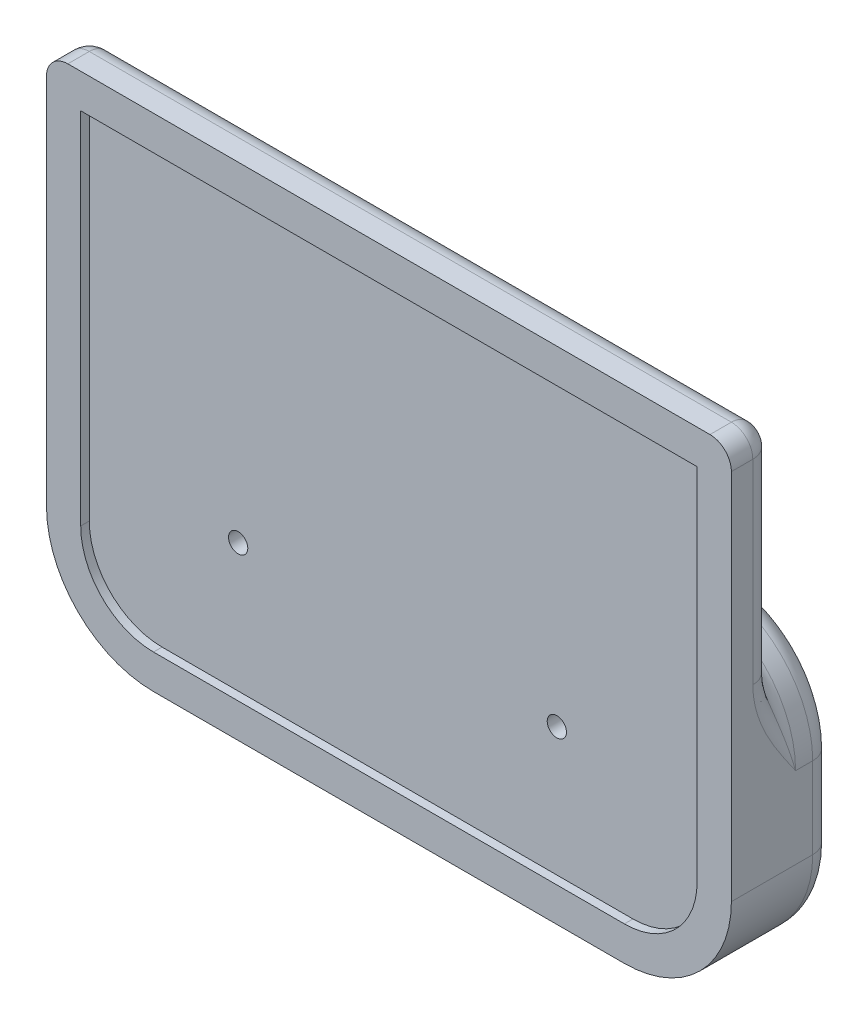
ISO-10303-21;
HEADER;
FILE_DESCRIPTION(('STEP AP214'),'2;1');
FILE_NAME('part.step','',(''),(''),'','','');
FILE_SCHEMA(('AUTOMOTIVE_DESIGN { 1 0 10303 214 1 1 1 1 }'));
ENDSEC;
DATA;
#1=APPLICATION_CONTEXT('core data for automotive mechanical design processes');
#2=APPLICATION_PROTOCOL_DEFINITION('international standard','automotive_design',2000,#1);
#3=PRODUCT_CONTEXT('',#1,'mechanical');
#4=PRODUCT('Part','Part','',(#3));
#5=PRODUCT_RELATED_PRODUCT_CATEGORY('part','',(#4));
#6=PRODUCT_DEFINITION_FORMATION('','',#4);
#7=PRODUCT_DEFINITION_CONTEXT('part definition',#1,'design');
#8=PRODUCT_DEFINITION('design','',#6,#7);
#9=PRODUCT_DEFINITION_SHAPE('','',#8);
#10=(LENGTH_UNIT() NAMED_UNIT(*) SI_UNIT(.MILLI.,.METRE.));
#11=(NAMED_UNIT(*) PLANE_ANGLE_UNIT() SI_UNIT($,.RADIAN.));
#12=(NAMED_UNIT(*) SI_UNIT($,.STERADIAN.) SOLID_ANGLE_UNIT());
#13=UNCERTAINTY_MEASURE_WITH_UNIT(LENGTH_MEASURE(1.E-05),#10,'distance_accuracy_value','');
#14=(GEOMETRIC_REPRESENTATION_CONTEXT(3) GLOBAL_UNCERTAINTY_ASSIGNED_CONTEXT((#13)) GLOBAL_UNIT_ASSIGNED_CONTEXT((#10,
#11,#12)) REPRESENTATION_CONTEXT('',''));
#15=CARTESIAN_POINT('',(0.,0.,0.));
#16=DIRECTION('',(0.,0.,1.));
#17=DIRECTION('',(1.,0.,0.));
#18=AXIS2_PLACEMENT_3D('',#15,#16,#17);
#19=CARTESIAN_POINT('',(-20.8941389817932,6.86845760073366,2.54));
#20=DIRECTION('',(0.,0.,1.));
#21=DIRECTION('',(1.,0.,0.));
#22=AXIS2_PLACEMENT_3D('',#19,#20,#21);
#23=PLANE('',#22);
#24=CARTESIAN_POINT('',(-13.97,-18.8895789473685,2.54));
#25=DIRECTION('',(0.,0.,1.));
#26=DIRECTION('',(1.,0.,0.));
#27=AXIS2_PLACEMENT_3D('',#24,#25,#26);
#28=CIRCLE('',#27,6.35);
#29=CARTESIAN_POINT('',(-13.97,-25.2395789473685,2.54));
#30=VERTEX_POINT('',#29);
#31=CARTESIAN_POINT('',(-20.32,-18.8895789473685,2.54));
#32=VERTEX_POINT('',#31);
#33=EDGE_CURVE('E348',#30,#32,#28,.F.);
#34=ORIENTED_EDGE('',*,*,#33,.F.);
#35=DIRECTION('',(1.,0.,0.));
#36=VECTOR('',#35,1.);
#37=CARTESIAN_POINT('',(0.,-25.2395789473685,2.54));
#38=LINE('',#37,#36);
#39=CARTESIAN_POINT('',(13.97,-25.2395789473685,2.54));
#40=VERTEX_POINT('',#39);
#41=EDGE_CURVE('E358',#30,#40,#38,.T.);
#42=ORIENTED_EDGE('',*,*,#41,.T.);
#43=CARTESIAN_POINT('',(13.97,-18.8895789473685,2.54));
#44=DIRECTION('',(0.,0.,1.));
#45=DIRECTION('',(1.,0.,0.));
#46=AXIS2_PLACEMENT_3D('',#43,#44,#45);
#47=CIRCLE('',#46,6.35);
#48=CARTESIAN_POINT('',(20.32,-18.8895789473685,2.54));
#49=VERTEX_POINT('',#48);
#50=EDGE_CURVE('E350',#49,#40,#47,.F.);
#51=ORIENTED_EDGE('',*,*,#50,.F.);
#52=DIRECTION('',(0.,1.,0.));
#53=VECTOR('',#52,1.);
#54=CARTESIAN_POINT('',(20.32,0.,2.54));
#55=LINE('',#54,#53);
#56=CARTESIAN_POINT('',(20.32,3.20842105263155,2.54));
#57=VERTEX_POINT('',#56);
#58=EDGE_CURVE('E352',#49,#57,#55,.T.);
#59=ORIENTED_EDGE('',*,*,#58,.T.);
#60=CARTESIAN_POINT('',(19.05,3.20842105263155,2.54));
#61=DIRECTION('',(0.,0.,1.));
#62=DIRECTION('',(1.,0.,0.));
#63=AXIS2_PLACEMENT_3D('',#60,#61,#62);
#64=CIRCLE('',#63,1.27);
#65=CARTESIAN_POINT('',(19.05,4.47842105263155,2.54));
#66=VERTEX_POINT('',#65);
#67=EDGE_CURVE('E346',#66,#57,#64,.F.);
#68=ORIENTED_EDGE('',*,*,#67,.F.);
#69=DIRECTION('',(1.,0.,0.));
#70=VECTOR('',#69,1.);
#71=CARTESIAN_POINT('',(0.,4.47842105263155,2.54));
#72=LINE('',#71,#70);
#73=CARTESIAN_POINT('',(-19.05,4.47842105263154,2.54));
#74=VERTEX_POINT('',#73);
#75=EDGE_CURVE('E11',#74,#66,#72,.T.);
#76=ORIENTED_EDGE('',*,*,#75,.F.);
#77=CARTESIAN_POINT('',(-19.05,3.20842105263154,2.54));
#78=DIRECTION('',(0.,0.,1.));
#79=DIRECTION('',(1.,0.,0.));
#80=AXIS2_PLACEMENT_3D('',#77,#78,#79);
#81=CIRCLE('',#80,1.27);
#82=CARTESIAN_POINT('',(-20.32,3.20842105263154,2.54));
#83=VERTEX_POINT('',#82);
#84=EDGE_CURVE('E250',#83,#74,#81,.F.);
#85=ORIENTED_EDGE('',*,*,#84,.F.);
#86=DIRECTION('',(0.,-1.,0.));
#87=VECTOR('',#86,1.);
#88=CARTESIAN_POINT('',(-20.32,0.,2.54));
#89=LINE('',#88,#87);
#90=EDGE_CURVE('E355',#83,#32,#89,.T.);
#91=ORIENTED_EDGE('',*,*,#90,.T.);
#92=EDGE_LOOP('',(#34,#42,#51,#59,#68,#76,#85,#91));
#93=FACE_BOUND('',#92,.T.);
#94=DIRECTION('',(0.,-1.,0.));
#95=VECTOR('',#94,1.);
#96=CARTESIAN_POINT('',(-18.288,0.,2.54));
#97=LINE('',#96,#95);
#98=CARTESIAN_POINT('',(-18.288,2.44642105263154,2.54));
#99=VERTEX_POINT('',#98);
#100=CARTESIAN_POINT('',(-18.288,-18.8895789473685,2.54));
#101=VERTEX_POINT('',#100);
#102=EDGE_CURVE('E340',#99,#101,#97,.T.);
#103=ORIENTED_EDGE('',*,*,#102,.F.);
#104=DIRECTION('',(1.,0.,0.));
#105=VECTOR('',#104,1.);
#106=CARTESIAN_POINT('',(-20.8941389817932,2.44642105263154,2.54));
#107=LINE('',#106,#105);
#108=CARTESIAN_POINT('',(18.288,2.44642105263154,2.54));
#109=VERTEX_POINT('',#108);
#110=EDGE_CURVE('E257',#99,#109,#107,.T.);
#111=ORIENTED_EDGE('',*,*,#110,.T.);
#112=DIRECTION('',(0.,1.,0.));
#113=VECTOR('',#112,1.);
#114=CARTESIAN_POINT('',(18.288,0.,2.54));
#115=LINE('',#114,#113);
#116=CARTESIAN_POINT('',(18.288,-18.8895789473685,2.54));
#117=VERTEX_POINT('',#116);
#118=EDGE_CURVE('E249',#117,#109,#115,.T.);
#119=ORIENTED_EDGE('',*,*,#118,.F.);
#120=CARTESIAN_POINT('',(13.97,-18.8895789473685,2.54));
#121=DIRECTION('',(0.,0.,1.));
#122=DIRECTION('',(1.,0.,0.));
#123=AXIS2_PLACEMENT_3D('',#120,#121,#122);
#124=CIRCLE('',#123,4.318);
#125=CARTESIAN_POINT('',(13.97,-23.2075789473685,2.54));
#126=VERTEX_POINT('',#125);
#127=EDGE_CURVE('E234',#117,#126,#124,.F.);
#128=ORIENTED_EDGE('',*,*,#127,.T.);
#129=DIRECTION('',(1.,0.,0.));
#130=VECTOR('',#129,1.);
#131=CARTESIAN_POINT('',(0.,-23.2075789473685,2.54));
#132=LINE('',#131,#130);
#133=CARTESIAN_POINT('',(-13.97,-23.2075789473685,2.54));
#134=VERTEX_POINT('',#133);
#135=EDGE_CURVE('E244',#134,#126,#132,.T.);
#136=ORIENTED_EDGE('',*,*,#135,.F.);
#137=CARTESIAN_POINT('',(-13.97,-18.8895789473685,2.54));
#138=DIRECTION('',(0.,0.,1.));
#139=DIRECTION('',(1.,0.,0.));
#140=AXIS2_PLACEMENT_3D('',#137,#138,#139);
#141=CIRCLE('',#140,4.318);
#142=EDGE_CURVE('E254',#134,#101,#141,.F.);
#143=ORIENTED_EDGE('',*,*,#142,.T.);
#144=EDGE_LOOP('',(#103,#111,#119,#128,#136,#143));
#145=FACE_BOUND('',#144,.T.);
#146=ADVANCED_FACE('F45',(#93,#145),#23,.T.);
#147=CARTESIAN_POINT('',(-20.8941389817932,2.44642105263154,-3.35834708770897));
#148=DIRECTION('',(0.,1.,0.));
#149=DIRECTION('',(0.,0.,1.));
#150=AXIS2_PLACEMENT_3D('',#147,#148,#149);
#151=PLANE('',#150);
#152=ORIENTED_EDGE('',*,*,#110,.F.);
#153=DIRECTION('',(0.,0.,-1.));
#154=VECTOR('',#153,1.);
#155=CARTESIAN_POINT('',(-18.288,2.44642105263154,-3.35834708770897));
#156=LINE('',#155,#154);
#157=CARTESIAN_POINT('',(-18.288,2.44642105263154,2.032));
#158=VERTEX_POINT('',#157);
#159=EDGE_CURVE('E276',#99,#158,#156,.T.);
#160=ORIENTED_EDGE('',*,*,#159,.T.);
#161=DIRECTION('',(-1.,0.,0.));
#162=VECTOR('',#161,1.);
#163=CARTESIAN_POINT('',(-20.8941389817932,2.44642105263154,2.032));
#164=LINE('',#163,#162);
#165=CARTESIAN_POINT('',(18.288,2.44642105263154,2.032));
#166=VERTEX_POINT('',#165);
#167=EDGE_CURVE('E240',#166,#158,#164,.T.);
#168=ORIENTED_EDGE('',*,*,#167,.F.);
#169=DIRECTION('',(0.,0.,-1.));
#170=VECTOR('',#169,1.);
#171=CARTESIAN_POINT('',(18.288,2.44642105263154,13.208));
#172=LINE('',#171,#170);
#173=EDGE_CURVE('E285',#109,#166,#172,.T.);
#174=ORIENTED_EDGE('',*,*,#173,.F.);
#175=EDGE_LOOP('',(#152,#160,#168,#174));
#176=FACE_BOUND('',#175,.T.);
#177=ADVANCED_FACE('F365',(#176),#151,.F.);
#178=CARTESIAN_POINT('',(0.,-23.2075789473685,13.208));
#179=DIRECTION('',(0.,1.,0.));
#180=DIRECTION('',(-1.,0.,0.));
#181=AXIS2_PLACEMENT_3D('',#178,#179,#180);
#182=PLANE('',#181);
#183=DIRECTION('',(0.,0.,1.));
#184=VECTOR('',#183,1.);
#185=CARTESIAN_POINT('',(-13.97,-23.2075789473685,13.208));
#186=LINE('',#185,#184);
#187=CARTESIAN_POINT('',(-13.97,-23.2075789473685,2.032));
#188=VERTEX_POINT('',#187);
#189=EDGE_CURVE('E241',#134,#188,#186,.F.);
#190=ORIENTED_EDGE('',*,*,#189,.F.);
#191=ORIENTED_EDGE('',*,*,#135,.T.);
#192=DIRECTION('',(0.,0.,1.));
#193=VECTOR('',#192,1.);
#194=CARTESIAN_POINT('',(13.97,-23.2075789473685,13.208));
#195=LINE('',#194,#193);
#196=CARTESIAN_POINT('',(13.97,-23.2075789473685,2.032));
#197=VERTEX_POINT('',#196);
#198=EDGE_CURVE('E230',#197,#126,#195,.T.);
#199=ORIENTED_EDGE('',*,*,#198,.F.);
#200=DIRECTION('',(-1.,0.,0.));
#201=VECTOR('',#200,1.);
#202=CARTESIAN_POINT('',(0.,-23.2075789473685,2.032));
#203=LINE('',#202,#201);
#204=EDGE_CURVE('E379',#197,#188,#203,.T.);
#205=ORIENTED_EDGE('',*,*,#204,.T.);
#206=EDGE_LOOP('',(#190,#191,#199,#205));
#207=FACE_BOUND('',#206,.T.);
#208=ADVANCED_FACE('F245',(#207),#182,.T.);
#209=CARTESIAN_POINT('',(18.288,0.,13.208));
#210=DIRECTION('',(-1.,0.,0.));
#211=DIRECTION('',(0.,-1.,0.));
#212=AXIS2_PLACEMENT_3D('',#209,#210,#211);
#213=PLANE('',#212);
#214=DIRECTION('',(0.,0.,1.));
#215=VECTOR('',#214,1.);
#216=CARTESIAN_POINT('',(18.288,-18.8895789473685,13.208));
#217=LINE('',#216,#215);
#218=CARTESIAN_POINT('',(18.288,-18.8895789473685,2.032));
#219=VERTEX_POINT('',#218);
#220=EDGE_CURVE('E281',#117,#219,#217,.F.);
#221=ORIENTED_EDGE('',*,*,#220,.F.);
#222=ORIENTED_EDGE('',*,*,#118,.T.);
#223=ORIENTED_EDGE('',*,*,#173,.T.);
#224=DIRECTION('',(0.,-1.,0.));
#225=VECTOR('',#224,1.);
#226=CARTESIAN_POINT('',(18.288,0.,2.032));
#227=LINE('',#226,#225);
#228=CARTESIAN_POINT('',(18.288,-8.38396628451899,2.032));
#229=VERTEX_POINT('',#228);
#230=EDGE_CURVE('E323',#166,#229,#227,.T.);
#231=ORIENTED_EDGE('',*,*,#230,.T.);
#232=DIRECTION('',(0.,1.,0.));
#233=VECTOR('',#232,1.);
#234=CARTESIAN_POINT('',(18.288,-28.3593371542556,2.032));
#235=LINE('',#234,#233);
#236=CARTESIAN_POINT('',(18.288,-12.1732871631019,2.032));
#237=VERTEX_POINT('',#236);
#238=EDGE_CURVE('E283',#237,#229,#235,.T.);
#239=ORIENTED_EDGE('',*,*,#238,.F.);
#240=DIRECTION('',(0.,-1.,0.));
#241=VECTOR('',#240,1.);
#242=CARTESIAN_POINT('',(18.288,0.,2.032));
#243=LINE('',#242,#241);
#244=EDGE_CURVE('E376',#237,#219,#243,.T.);
#245=ORIENTED_EDGE('',*,*,#244,.T.);
#246=EDGE_LOOP('',(#221,#222,#223,#231,#239,#245));
#247=FACE_BOUND('',#246,.T.);
#248=ADVANCED_FACE('F369',(#247),#213,.T.);
#249=CARTESIAN_POINT('',(-18.288,0.,13.208));
#250=DIRECTION('',(1.,0.,0.));
#251=DIRECTION('',(0.,1.,0.));
#252=AXIS2_PLACEMENT_3D('',#249,#250,#251);
#253=PLANE('',#252);
#254=ORIENTED_EDGE('',*,*,#159,.F.);
#255=ORIENTED_EDGE('',*,*,#102,.T.);
#256=DIRECTION('',(0.,0.,1.));
#257=VECTOR('',#256,1.);
#258=CARTESIAN_POINT('',(-18.288,-18.8895789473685,13.208));
#259=LINE('',#258,#257);
#260=CARTESIAN_POINT('',(-18.288,-18.8895789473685,2.032));
#261=VERTEX_POINT('',#260);
#262=EDGE_CURVE('E278',#261,#101,#259,.T.);
#263=ORIENTED_EDGE('',*,*,#262,.F.);
#264=DIRECTION('',(0.,1.,0.));
#265=VECTOR('',#264,1.);
#266=CARTESIAN_POINT('',(-18.288,0.,2.032));
#267=LINE('',#266,#265);
#268=CARTESIAN_POINT('',(-18.288,-12.1732871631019,2.032));
#269=VERTEX_POINT('',#268);
#270=EDGE_CURVE('E286',#261,#269,#267,.T.);
#271=ORIENTED_EDGE('',*,*,#270,.T.);
#272=DIRECTION('',(0.,-1.,0.));
#273=VECTOR('',#272,1.);
#274=CARTESIAN_POINT('',(-18.288,-28.3593371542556,2.032));
#275=LINE('',#274,#273);
#276=CARTESIAN_POINT('',(-18.288,-8.383966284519,2.032));
#277=VERTEX_POINT('',#276);
#278=EDGE_CURVE('E390',#277,#269,#275,.T.);
#279=ORIENTED_EDGE('',*,*,#278,.F.);
#280=DIRECTION('',(0.,-1.,0.));
#281=VECTOR('',#280,1.);
#282=CARTESIAN_POINT('',(-18.288,-28.3593371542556,2.032));
#283=LINE('',#282,#281);
#284=EDGE_CURVE('E279',#158,#277,#283,.T.);
#285=ORIENTED_EDGE('',*,*,#284,.F.);
#286=EDGE_LOOP('',(#254,#255,#263,#271,#279,#285));
#287=FACE_BOUND('',#286,.T.);
#288=ADVANCED_FACE('F579',(#287),#253,.T.);
#289=CARTESIAN_POINT('',(-13.97,-18.8895789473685,13.208));
#290=DIRECTION('',(0.,0.,-1.));
#291=DIRECTION('',(-1.,0.,0.));
#292=AXIS2_PLACEMENT_3D('',#289,#290,#291);
#293=CYLINDRICAL_SURFACE('',#292,4.318);
#294=ORIENTED_EDGE('',*,*,#142,.F.);
#295=ORIENTED_EDGE('',*,*,#189,.T.);
#296=CARTESIAN_POINT('',(-13.97,-18.8895789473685,2.032));
#297=DIRECTION('',(0.,0.,-1.));
#298=DIRECTION('',(-1.,0.,0.));
#299=AXIS2_PLACEMENT_3D('',#296,#297,#298);
#300=CIRCLE('',#299,4.318);
#301=EDGE_CURVE('E391',#261,#188,#300,.F.);
#302=ORIENTED_EDGE('',*,*,#301,.F.);
#303=ORIENTED_EDGE('',*,*,#262,.T.);
#304=EDGE_LOOP('',(#294,#295,#302,#303));
#305=FACE_BOUND('',#304,.T.);
#306=ADVANCED_FACE('F47',(#305),#293,.F.);
#307=CARTESIAN_POINT('',(13.97,-18.8895789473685,13.208));
#308=DIRECTION('',(0.,0.,-1.));
#309=DIRECTION('',(-1.,0.,0.));
#310=AXIS2_PLACEMENT_3D('',#307,#308,#309);
#311=CYLINDRICAL_SURFACE('',#310,4.318);
#312=ORIENTED_EDGE('',*,*,#127,.F.);
#313=ORIENTED_EDGE('',*,*,#220,.T.);
#314=CARTESIAN_POINT('',(13.97,-18.8895789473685,2.032));
#315=DIRECTION('',(0.,0.,-1.));
#316=DIRECTION('',(-1.,0.,0.));
#317=AXIS2_PLACEMENT_3D('',#314,#315,#316);
#318=CIRCLE('',#317,4.318);
#319=EDGE_CURVE('E236',#197,#219,#318,.F.);
#320=ORIENTED_EDGE('',*,*,#319,.F.);
#321=ORIENTED_EDGE('',*,*,#198,.T.);
#322=EDGE_LOOP('',(#312,#313,#320,#321));
#323=FACE_BOUND('',#322,.T.);
#324=ADVANCED_FACE('F232',(#323),#311,.F.);
#325=CARTESIAN_POINT('',(-20.8941389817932,-28.3593371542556,2.032));
#326=DIRECTION('',(0.,0.,-1.));
#327=DIRECTION('',(-1.,0.,0.));
#328=AXIS2_PLACEMENT_3D('',#325,#326,#327);
#329=PLANE('',#328);
#330=CARTESIAN_POINT('',(9.45484266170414,-15.5875789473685,2.032));
#331=DIRECTION('',(0.,0.,-1.));
#332=DIRECTION('',(-1.,0.,0.));
#333=AXIS2_PLACEMENT_3D('',#330,#331,#332);
#334=CIRCLE('',#333,0.571499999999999);
#335=CARTESIAN_POINT('',(8.88334266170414,-15.5875789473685,2.032));
#336=VERTEX_POINT('',#335);
#337=EDGE_CURVE('E759',#336,#336,#334,.T.);
#338=ORIENTED_EDGE('',*,*,#337,.T.);
#339=EDGE_LOOP('',(#338));
#340=FACE_BOUND('',#339,.T.);
#341=CARTESIAN_POINT('',(-9.45484266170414,-15.5875789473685,2.032));
#342=DIRECTION('',(0.,0.,-1.));
#343=DIRECTION('',(-1.,0.,0.));
#344=AXIS2_PLACEMENT_3D('',#341,#342,#343);
#345=CIRCLE('',#344,0.571499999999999);
#346=CARTESIAN_POINT('',(-10.0263426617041,-15.5875789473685,2.032));
#347=VERTEX_POINT('',#346);
#348=EDGE_CURVE('E255',#347,#347,#345,.F.);
#349=ORIENTED_EDGE('',*,*,#348,.F.);
#350=EDGE_LOOP('',(#349));
#351=FACE_BOUND('',#350,.T.);
#352=ORIENTED_EDGE('',*,*,#278,.T.);
#353=ORIENTED_EDGE('',*,*,#270,.F.);
#354=ORIENTED_EDGE('',*,*,#301,.T.);
#355=ORIENTED_EDGE('',*,*,#204,.F.);
#356=ORIENTED_EDGE('',*,*,#319,.T.);
#357=ORIENTED_EDGE('',*,*,#244,.F.);
#358=ORIENTED_EDGE('',*,*,#238,.T.);
#359=ORIENTED_EDGE('',*,*,#230,.F.);
#360=ORIENTED_EDGE('',*,*,#167,.T.);
#361=ORIENTED_EDGE('',*,*,#284,.T.);
#362=EDGE_LOOP('',(#352,#353,#354,#355,#356,#357,#358,#359,#360,#361));
#363=FACE_BOUND('',#362,.T.);
#364=ADVANCED_FACE('F373',(#340,#351,#363),#329,.F.);
#365=CARTESIAN_POINT('',(20.32,0.,13.208));
#366=DIRECTION('',(-1.,0.,0.));
#367=DIRECTION('',(0.,-1.,0.));
#368=AXIS2_PLACEMENT_3D('',#365,#366,#367);
#369=PLANE('',#368);
#370=ORIENTED_EDGE('',*,*,#58,.F.);
#371=DIRECTION('',(0.,0.,-1.));
#372=VECTOR('',#371,1.);
#373=CARTESIAN_POINT('',(20.32,-18.8895789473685,13.208));
#374=LINE('',#373,#372);
#375=CARTESIAN_POINT('',(20.32,-18.8895789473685,-2.286));
#376=VERTEX_POINT('',#375);
#377=EDGE_CURVE('E264',#49,#376,#374,.T.);
#378=ORIENTED_EDGE('',*,*,#377,.T.);
#379=DIRECTION('',(0.,-1.,0.));
#380=VECTOR('',#379,1.);
#381=CARTESIAN_POINT('',(20.32,0.,-2.286));
#382=LINE('',#381,#380);
#383=CARTESIAN_POINT('',(20.32,-14.0635789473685,-2.286));
#384=VERTEX_POINT('',#383);
#385=EDGE_CURVE('E820',#376,#384,#382,.F.);
#386=ORIENTED_EDGE('',*,*,#385,.T.);
#387=DIRECTION('',(0.,0.,1.));
#388=VECTOR('',#387,1.);
#389=CARTESIAN_POINT('',(20.32,-14.0635789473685,-3.556));
#390=LINE('',#389,#388);
#391=CARTESIAN_POINT('',(20.32,-14.0635789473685,-1.27));
#392=VERTEX_POINT('',#391);
#393=EDGE_CURVE('E849',#384,#392,#390,.T.);
#394=ORIENTED_EDGE('',*,*,#393,.T.);
#395=CARTESIAN_POINT('',(20.32,-7.113966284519,1.0698256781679));
#396=CARTESIAN_POINT('',(20.32,-7.63182904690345,-0.44879971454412));
#397=CARTESIAN_POINT('',(18.7583777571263,-7.51291542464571,-0.100087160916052));
#398=CARTESIAN_POINT('',(20.32,-7.21648194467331,1.10477975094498));
#399=CARTESIAN_POINT('',(20.32,-7.67634091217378,-0.403477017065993));
#400=CARTESIAN_POINT('',(18.7799899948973,-7.57997399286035,-0.0826101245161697));
#401=CARTESIAN_POINT('',(20.32,-7.32055396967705,1.13483026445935));
#402=CARTESIAN_POINT('',(20.32,-7.72645360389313,-0.358872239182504));
#403=CARTESIAN_POINT('',(18.8023962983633,-7.64873534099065,-0.0675848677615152));
#404=CARTESIAN_POINT('',(20.32,-7.53082992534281,1.18558757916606));
#405=CARTESIAN_POINT('',(20.32,-7.83629023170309,-0.273625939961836));
#406=CARTESIAN_POINT('',(18.8486561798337,-7.78927511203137,-0.0422062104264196));
#407=CARTESIAN_POINT('',(20.32,-7.63703114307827,1.20630556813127));
#408=CARTESIAN_POINT('',(20.32,-7.89575588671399,-0.232924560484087));
#409=CARTESIAN_POINT('',(18.8725079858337,-7.86104980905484,-0.0318472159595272));
#410=CARTESIAN_POINT('',(20.32,-7.95553018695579,1.25492463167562));
#411=CARTESIAN_POINT('',(20.32,-8.08389796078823,-0.120443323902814));
#412=CARTESIAN_POINT('',(18.9455953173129,-8.07905014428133,-0.00753768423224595));
#413=CARTESIAN_POINT('',(20.32,-8.16987289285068,1.26998914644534));
#414=CARTESIAN_POINT('',(20.32,-8.22607569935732,-0.0543463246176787));
#415=CARTESIAN_POINT('',(18.9968133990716,-8.22934801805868,-5.42687467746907E-06));
#416=CARTESIAN_POINT('',(20.32,-8.53300011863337,1.27000755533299));
#417=CARTESIAN_POINT('',(20.32,-8.49002873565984,0.036506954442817));
#418=CARTESIAN_POINT('',(19.0870240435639,-8.49159853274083,3.77773425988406E-06));
#419=CARTESIAN_POINT('',(20.32,-8.68191314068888,1.26272044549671));
#420=CARTESIAN_POINT('',(20.32,-8.60326138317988,0.0677404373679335));
#421=CARTESIAN_POINT('',(19.1250019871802,-8.60132434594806,-0.00363977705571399));
#422=CARTESIAN_POINT('',(20.32,-8.97857728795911,1.23511827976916));
#423=CARTESIAN_POINT('',(20.32,-8.83886710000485,0.117513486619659));
#424=CARTESIAN_POINT('',(19.2024566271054,-8.82484190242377,-0.0174408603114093));
#425=CARTESIAN_POINT('',(20.32,-9.1263280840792,1.21479965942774));
#426=CARTESIAN_POINT('',(20.32,-8.96100715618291,0.13639821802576));
#427=CARTESIAN_POINT('',(19.2419337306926,-8.93863475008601,-0.0276001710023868));
#428=CARTESIAN_POINT('',(20.32,-9.42036687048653,1.16249936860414));
#429=CARTESIAN_POINT('',(20.32,-9.2124191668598,0.161644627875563));
#430=CARTESIAN_POINT('',(19.3220158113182,-9.1705748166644,-0.053750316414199));
#431=CARTESIAN_POINT('',(20.32,-9.56664568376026,1.13046727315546));
#432=CARTESIAN_POINT('',(20.32,-9.34161487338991,0.168287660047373));
#433=CARTESIAN_POINT('',(19.3626249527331,-9.28873884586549,-0.0697663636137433));
#434=CARTESIAN_POINT('',(20.32,-9.85654585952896,1.05618788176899));
#435=CARTESIAN_POINT('',(20.32,-9.60456251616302,0.169517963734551));
#436=CARTESIAN_POINT('',(19.4442061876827,-9.52891780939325,-0.106906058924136));
#437=CARTESIAN_POINT('',(20.32,-10.0001674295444,1.01394138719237));
#438=CARTESIAN_POINT('',(20.32,-9.73829489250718,0.164402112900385));
#439=CARTESIAN_POINT('',(19.4851782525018,-9.65093244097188,-0.128029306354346));
#440=CARTESIAN_POINT('',(20.32,-10.2967227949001,0.916534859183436));
#441=CARTESIAN_POINT('',(20.32,-10.02004035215,0.142125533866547));
#442=CARTESIAN_POINT('',(19.5703409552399,-9.90953909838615,-0.176732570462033));
#443=CARTESIAN_POINT('',(20.32,-10.4493922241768,0.860575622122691));
#444=CARTESIAN_POINT('',(20.32,-10.1686789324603,0.124240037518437));
#445=CARTESIAN_POINT('',(19.6145046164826,-10.0464811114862,-0.204712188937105));
#446=CARTESIAN_POINT('',(20.32,-10.7511794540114,0.739718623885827));
#447=CARTESIAN_POINT('',(20.32,-10.4677929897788,0.076684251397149));
#448=CARTESIAN_POINT('',(19.7015457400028,-10.3250474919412,-0.265140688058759));
#449=CARTESIAN_POINT('',(20.32,-10.9002960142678,0.674817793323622));
#450=CARTESIAN_POINT('',(20.32,-10.6184494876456,0.0472417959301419));
#451=CARTESIAN_POINT('',(19.7444227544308,-10.4666734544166,-0.297591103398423));
#452=CARTESIAN_POINT('',(20.32,-11.195193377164,0.537430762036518));
#453=CARTESIAN_POINT('',(20.32,-10.9205649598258,-0.0219517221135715));
#454=CARTESIAN_POINT('',(19.8279057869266,-10.7547413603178,-0.366284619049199));
#455=CARTESIAN_POINT('',(20.32,-11.3409698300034,0.464935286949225));
#456=CARTESIAN_POINT('',(20.32,-11.0722843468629,-0.0615679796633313));
#457=CARTESIAN_POINT('',(19.8685089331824,-10.9011890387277,-0.402532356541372));
#458=CARTESIAN_POINT('',(20.32,-11.6292671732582,0.313709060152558));
#459=CARTESIAN_POINT('',(20.32,-11.3755783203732,-0.149545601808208));
#460=CARTESIAN_POINT('',(19.9463246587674,-11.1986482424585,-0.478145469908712));
#461=CARTESIAN_POINT('',(20.32,-11.7717874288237,0.234977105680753));
#462=CARTESIAN_POINT('',(20.32,-11.5274695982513,-0.197842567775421));
#463=CARTESIAN_POINT('',(19.9835365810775,-11.3496606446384,-0.517511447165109));
#464=CARTESIAN_POINT('',(20.32,-12.0542521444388,0.0722738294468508));
#465=CARTESIAN_POINT('',(20.32,-11.8309549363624,-0.301759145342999));
#466=CARTESIAN_POINT('',(20.0535752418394,-11.6563250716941,-0.598863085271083));
#467=CARTESIAN_POINT('',(20.32,-12.194189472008,-0.0117098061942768));
#468=CARTESIAN_POINT('',(20.32,-11.9829184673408,-0.357408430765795));
#469=CARTESIAN_POINT('',(20.0863910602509,-11.8119875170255,-0.640854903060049));
#470=CARTESIAN_POINT('',(20.32,-12.4715989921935,-0.183659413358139));
#471=CARTESIAN_POINT('',(20.32,-12.2859437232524,-0.474431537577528));
#472=CARTESIAN_POINT('',(20.1465079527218,-12.1271521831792,-0.726829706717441));
#473=CARTESIAN_POINT('',(20.32,-12.6090709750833,-0.27162572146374));
#474=CARTESIAN_POINT('',(20.32,-12.4374077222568,-0.535884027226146));
#475=CARTESIAN_POINT('',(20.1738085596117,-12.286654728,-0.770812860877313));
#476=CARTESIAN_POINT('',(20.32,-12.8819753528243,-0.450468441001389));
#477=CARTESIAN_POINT('',(20.32,-12.7392631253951,-0.663006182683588));
#478=CARTESIAN_POINT('',(20.2219683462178,-12.6087297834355,-0.860234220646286));
#479=CARTESIAN_POINT('',(20.32,-13.0174089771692,-0.541342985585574));
#480=CARTESIAN_POINT('',(20.32,-12.8900827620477,-0.728807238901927));
#481=CARTESIAN_POINT('',(20.2428315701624,-12.7713002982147,-0.90567149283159));
#482=CARTESIAN_POINT('',(20.32,-13.2868948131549,-0.725110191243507));
#483=CARTESIAN_POINT('',(20.32,-13.1908173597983,-0.863251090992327));
#484=CARTESIAN_POINT('',(20.2774094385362,-13.098776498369,-0.997555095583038));
#485=CARTESIAN_POINT('',(20.32,-13.4209470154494,-0.818002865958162));
#486=CARTESIAN_POINT('',(20.32,-13.341179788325,-0.93207146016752));
#487=CARTESIAN_POINT('',(20.2911240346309,-13.2636821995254,-1.04400143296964));
#488=CARTESIAN_POINT('',(20.32,-13.6377315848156,-0.969570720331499));
#489=CARTESIAN_POINT('',(20.32,-13.5846310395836,-1.04496978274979));
#490=CARTESIAN_POINT('',(20.3071741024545,-13.5322438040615,-1.11978536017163));
#491=CARTESIAN_POINT('',(20.32,-13.720704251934,-1.02790386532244));
#492=CARTESIAN_POINT('',(20.32,-13.6779114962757,-1.08857687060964));
#493=CARTESIAN_POINT('',(20.3118513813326,-13.6354838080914,-1.1489519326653));
#494=CARTESIAN_POINT('',(20.32,-13.8864323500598,-1.14474649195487));
#495=CARTESIAN_POINT('',(20.32,-13.8642337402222,-1.17603669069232));
#496=CARTESIAN_POINT('',(20.3181870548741,-13.8421573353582,-1.2073732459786));
#497=CARTESIAN_POINT('',(20.32,-13.9691878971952,-1.2032558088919));
#498=CARTESIAN_POINT('',(20.3200000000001,-13.9573865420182,-1.2199408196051));
#499=CARTESIAN_POINT('',(20.3198477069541,-13.9455906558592,-1.236627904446));
#500=CARTESIAN_POINT('',(20.32,-14.055819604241,-1.26451331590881));
#501=CARTESIAN_POINT('',(20.32,-14.0548496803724,-1.26588498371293));
#502=CARTESIAN_POINT('',(20.3199966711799,-14.0538797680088,-1.2672566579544));
#503=CARTESIAN_POINT('',(20.32,-14.0596992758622,-1.26725665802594));
#504=CARTESIAN_POINT('',(20.32,-14.0592143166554,-1.26794249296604));
#505=CARTESIAN_POINT('',(20.3200000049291,-14.058729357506,-1.26862832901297));
#506=CARTESIAN_POINT('',(20.32,-14.0635789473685,-1.27));
#507=CARTESIAN_POINT('',(20.32,-14.0635789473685,-1.27));
#508=CARTESIAN_POINT('',(20.32,-14.0635789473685,-1.27));
#509=(BOUNDED_SURFACE() B_SPLINE_SURFACE(3,2,((#395,#396,#397),(#398,#399,#400),(#401,#402,
#403),(#404,#405,#406),(#407,#408,#409),(#410,#411,#412),(#413,#414,#415),(#416,#417,#418),
(#419,#420,#421),(#422,#423,#424),(#425,#426,#427),(#428,#429,#430),(#431,#432,#433),(#434,#435,
#436),(#437,#438,#439),(#440,#441,#442),(#443,#444,#445),(#446,#447,#448),(#449,#450,#451),
(#452,#453,#454),(#455,#456,#457),(#458,#459,#460),(#461,#462,#463),(#464,#465,#466),(#467,#468,
#469),(#470,#471,#472),(#473,#474,#475),(#476,#477,#478),(#479,#480,#481),(#482,#483,#484),
(#485,#486,#487),(#488,#489,#490),(#491,#492,#493),(#494,#495,#496),(#497,#498,#499),(#500,#501,
#502),(#503,#504,#505),(#506,#507,#508)),.UNSPECIFIED.,.F.,.F.,
.F.) B_SPLINE_SURFACE_WITH_KNOTS((4,2,2,2,2,2,2,2,2,2,2,2,2,2,2,2,2,2,4),(3,3),(0.,
0.324629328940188,0.648868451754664,1.29065255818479,1.73740873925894,2.18428717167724,
2.63311245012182,3.08190252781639,3.56937564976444,4.05701652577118,4.54525999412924,
5.03359785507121,5.52312711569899,6.01269782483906,6.50196033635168,6.99122615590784,
7.29550370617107,7.59955346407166,7.61380828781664),(0.,1.),
.UNSPECIFIED.) GEOMETRIC_REPRESENTATION_ITEM() RATIONAL_B_SPLINE_SURFACE(((1.,0.620635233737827,
1.),(1.,0.6274908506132,1.),(1.,0.634483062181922,1.),(1.,0.648676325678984,1.),(1.,
0.655877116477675,1.),(1.,0.677571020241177,1.),(1.,0.692299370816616,1.),(1.,0.717414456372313,
1.),(1.,0.727760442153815,1.),(1.,0.748417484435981,1.),(1.,0.758728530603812,1.),(1.,
0.779229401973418,1.),(1.,0.789418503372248,1.),(1.,0.809506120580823,1.),(1.,0.819404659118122,
1.),(1.,0.8396245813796,1.),(1.,0.849908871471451,1.),(1.,0.869835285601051,1.),(1.,
0.879477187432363,1.),(1.,0.897968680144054,1.),(1.,0.906817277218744,1.),(1.,0.923554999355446,
1.),(1.,0.931443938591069,1.),(1.,0.946130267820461,1.),(1.,0.952924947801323,1.),(1.,
0.965263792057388,1.),(1.,0.970807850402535,1.),(1.,0.980524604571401,1.),(1.,0.984698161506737,
1.),(1.,0.991586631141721,1.),(1.,0.994301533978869,1.),(1.,0.997472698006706,1.),(1.,
0.998394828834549,1.),(1.,0.999643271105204,1.),(1.,0.999970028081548,1.),(1.,0.999999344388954,
1.),(1.,1.00000000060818,1.),(1.,1.,1.))) REPRESENTATION_ITEM('') SURFACE());
#510=CARTESIAN_POINT('',(20.32,-7.113966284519,1.0698256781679));
#511=CARTESIAN_POINT('',(20.32,-7.21648194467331,1.10477975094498));
#512=CARTESIAN_POINT('',(20.32,-7.32055396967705,1.13483026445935));
#513=CARTESIAN_POINT('',(20.32,-7.53082992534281,1.18558757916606));
#514=CARTESIAN_POINT('',(20.32,-7.63703114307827,1.20630556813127));
#515=CARTESIAN_POINT('',(20.32,-7.95553018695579,1.25492463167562));
#516=CARTESIAN_POINT('',(20.32,-8.16987289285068,1.26998914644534));
#517=CARTESIAN_POINT('',(20.32,-8.53300011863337,1.27000755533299));
#518=CARTESIAN_POINT('',(20.32,-8.68191314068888,1.26272044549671));
#519=CARTESIAN_POINT('',(20.32,-8.97857728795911,1.23511827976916));
#520=CARTESIAN_POINT('',(20.32,-9.1263280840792,1.21479965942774));
#521=CARTESIAN_POINT('',(20.32,-9.42036687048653,1.16249936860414));
#522=CARTESIAN_POINT('',(20.32,-9.56664568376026,1.13046727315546));
#523=CARTESIAN_POINT('',(20.32,-9.85654585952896,1.05618788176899));
#524=CARTESIAN_POINT('',(20.32,-10.0001674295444,1.01394138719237));
#525=CARTESIAN_POINT('',(20.32,-10.2967227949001,0.916534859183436));
#526=CARTESIAN_POINT('',(20.32,-10.4493922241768,0.860575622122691));
#527=CARTESIAN_POINT('',(20.32,-10.7511794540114,0.739718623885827));
#528=CARTESIAN_POINT('',(20.32,-10.9002960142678,0.674817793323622));
#529=CARTESIAN_POINT('',(20.32,-11.195193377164,0.537430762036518));
#530=CARTESIAN_POINT('',(20.32,-11.3409698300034,0.464935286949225));
#531=CARTESIAN_POINT('',(20.32,-11.6292671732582,0.313709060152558));
#532=CARTESIAN_POINT('',(20.32,-11.7717874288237,0.234977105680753));
#533=CARTESIAN_POINT('',(20.32,-12.0542521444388,0.0722738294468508));
#534=CARTESIAN_POINT('',(20.32,-12.194189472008,-0.0117098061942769));
#535=CARTESIAN_POINT('',(20.32,-12.4715989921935,-0.183659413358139));
#536=CARTESIAN_POINT('',(20.32,-12.6090709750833,-0.27162572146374));
#537=CARTESIAN_POINT('',(20.32,-12.8819753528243,-0.450468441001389));
#538=CARTESIAN_POINT('',(20.32,-13.0174089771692,-0.541342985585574));
#539=CARTESIAN_POINT('',(20.32,-13.2868948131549,-0.725110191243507));
#540=CARTESIAN_POINT('',(20.32,-13.4209470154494,-0.818002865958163));
#541=CARTESIAN_POINT('',(20.32,-13.6377315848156,-0.969570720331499));
#542=CARTESIAN_POINT('',(20.32,-13.720704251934,-1.02790386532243));
#543=CARTESIAN_POINT('',(20.32,-13.8864323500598,-1.14474649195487));
#544=CARTESIAN_POINT('',(20.32,-13.9691878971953,-1.20325580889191));
#545=CARTESIAN_POINT('',(20.32,-14.055819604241,-1.26451331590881));
#546=CARTESIAN_POINT('',(20.32,-14.0596992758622,-1.26725665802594));
#547=CARTESIAN_POINT('',(20.32,-14.0635789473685,-1.27));
#548=B_SPLINE_CURVE_WITH_KNOTS('',3,(#510,#511,#512,#513,#514,#515,#516,#517,#518,#519,#520,
#521,#522,#523,#524,#525,#526,#527,#528,#529,#530,#531,#532,#533,#534,#535,#536,#537,#538,#539,
#540,#541,#542,#543,#544,#545,#546,#547),.UNSPECIFIED.,.F.,.F.,(4,2,2,2,2,2,2,2,2,2,2,2,2,2,2,2,
2,2,4),(0.,0.324629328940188,0.648868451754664,1.29065255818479,1.73740873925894,
2.18428717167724,2.63311245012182,3.08190252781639,3.56937564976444,4.05701652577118,
4.54525999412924,5.03359785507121,5.52312711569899,6.01269782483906,6.50196033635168,
6.99122615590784,7.29550370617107,7.59955346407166,7.61380828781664),.UNSPECIFIED.);
#549=CARTESIAN_POINT('',(20.32,-8.383966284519,1.27));
#550=VERTEX_POINT('',#549);
#551=EDGE_CURVE('E413',#392,#550,#548,.F.);
#552=ORIENTED_EDGE('',*,*,#551,.T.);
#553=DIRECTION('',(0.,1.,0.));
#554=VECTOR('',#553,1.);
#555=CARTESIAN_POINT('',(20.32,0.,1.27));
#556=LINE('',#555,#554);
#557=CARTESIAN_POINT('',(20.32,3.20842105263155,1.27));
#558=VERTEX_POINT('',#557);
#559=EDGE_CURVE('E290',#550,#558,#556,.T.);
#560=ORIENTED_EDGE('',*,*,#559,.T.);
#561=DIRECTION('',(0.,0.,-1.));
#562=VECTOR('',#561,1.);
#563=CARTESIAN_POINT('',(20.32,3.20842105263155,2.54));
#564=LINE('',#563,#562);
#565=EDGE_CURVE('E287',#558,#57,#564,.F.);
#566=ORIENTED_EDGE('',*,*,#565,.T.);
#567=EDGE_LOOP('',(#370,#378,#386,#394,#552,#560,#566));
#568=FACE_BOUND('',#567,.T.);
#569=ADVANCED_FACE('F495',(#568),#369,.F.);
#570=CARTESIAN_POINT('',(-20.32,0.,13.208));
#571=DIRECTION('',(1.,0.,0.));
#572=DIRECTION('',(0.,1.,0.));
#573=AXIS2_PLACEMENT_3D('',#570,#571,#572);
#574=PLANE('',#573);
#575=ORIENTED_EDGE('',*,*,#90,.F.);
#576=DIRECTION('',(0.,0.,-1.));
#577=VECTOR('',#576,1.);
#578=CARTESIAN_POINT('',(-20.32,3.20842105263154,0.));
#579=LINE('',#578,#577);
#580=CARTESIAN_POINT('',(-20.32,3.20842105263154,1.27));
#581=VERTEX_POINT('',#580);
#582=EDGE_CURVE('E49',#83,#581,#579,.T.);
#583=ORIENTED_EDGE('',*,*,#582,.T.);
#584=DIRECTION('',(0.,-1.,0.));
#585=VECTOR('',#584,1.);
#586=CARTESIAN_POINT('',(-20.32,0.,1.27));
#587=LINE('',#586,#585);
#588=CARTESIAN_POINT('',(-20.32,-8.383966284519,1.27));
#589=VERTEX_POINT('',#588);
#590=EDGE_CURVE('E317',#581,#589,#587,.T.);
#591=ORIENTED_EDGE('',*,*,#590,.T.);
#592=CARTESIAN_POINT('',(-18.7583777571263,-7.51291542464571,-0.100087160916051));
#593=CARTESIAN_POINT('',(-20.32,-7.63182904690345,-0.448799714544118));
#594=CARTESIAN_POINT('',(-20.32,-7.113966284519,1.0698256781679));
#595=CARTESIAN_POINT('',(-18.7799899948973,-7.57997399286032,-0.0826101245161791));
#596=CARTESIAN_POINT('',(-20.32,-7.67634091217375,-0.403477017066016));
#597=CARTESIAN_POINT('',(-20.32,-7.21648194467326,1.10477975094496));
#598=CARTESIAN_POINT('',(-18.8023962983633,-7.64873534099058,-0.067584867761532));
#599=CARTESIAN_POINT('',(-20.32,-7.72645360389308,-0.358872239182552));
#600=CARTESIAN_POINT('',(-20.32,-7.32055396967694,1.13483026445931));
#601=CARTESIAN_POINT('',(-18.8486561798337,-7.78927511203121,-0.0422062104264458));
#602=CARTESIAN_POINT('',(-20.32,-7.83629023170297,-0.273625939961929));
#603=CARTESIAN_POINT('',(-20.32,-7.53082992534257,1.185587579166));
#604=CARTESIAN_POINT('',(-18.8725079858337,-7.86104980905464,-0.0318472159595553));
#605=CARTESIAN_POINT('',(-20.32,-7.89575588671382,-0.232924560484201));
#606=CARTESIAN_POINT('',(-20.32,-7.63703114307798,1.20630556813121));
#607=CARTESIAN_POINT('',(-18.9455953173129,-8.07905014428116,-0.00753768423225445));
#608=CARTESIAN_POINT('',(-20.32,-8.08389796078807,-0.120443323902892));
#609=CARTESIAN_POINT('',(-20.32,-7.95553018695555,1.2549246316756));
#610=CARTESIAN_POINT('',(-18.9968133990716,-8.2293480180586,-5.4268746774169E-06));
#611=CARTESIAN_POINT('',(-20.32,-8.22607569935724,-0.0543463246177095));
#612=CARTESIAN_POINT('',(-20.32,-8.16987289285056,1.26998914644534));
#613=CARTESIAN_POINT('',(-19.0870240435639,-8.49159853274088,3.77773425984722E-06));
#614=CARTESIAN_POINT('',(-20.32,-8.49002873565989,0.0365069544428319));
#615=CARTESIAN_POINT('',(-20.32,-8.53300011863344,1.27000755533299));
#616=CARTESIAN_POINT('',(-19.1250019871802,-8.60132434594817,-0.0036397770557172));
#617=CARTESIAN_POINT('',(-20.32,-8.60326138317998,0.0677404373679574));
#618=CARTESIAN_POINT('',(-20.32,-8.68191314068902,1.2627204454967));
#619=CARTESIAN_POINT('',(-19.2024566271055,-8.82484190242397,-0.0174408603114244));
#620=CARTESIAN_POINT('',(-20.32,-8.83886710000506,0.117513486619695));
#621=CARTESIAN_POINT('',(-20.32,-8.97857728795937,1.23511827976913));
#622=CARTESIAN_POINT('',(-19.2419337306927,-8.93863475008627,-0.0276001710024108));
#623=CARTESIAN_POINT('',(-20.32,-8.96100715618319,0.1363982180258));
#624=CARTESIAN_POINT('',(-20.32,-9.12632808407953,1.21479965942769));
#625=CARTESIAN_POINT('',(-19.3220158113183,-9.17057481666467,-0.0537503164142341));
#626=CARTESIAN_POINT('',(-20.32,-9.21241916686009,0.161644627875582));
#627=CARTESIAN_POINT('',(-20.32,-9.42036687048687,1.16249936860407));
#628=CARTESIAN_POINT('',(-19.3626249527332,-9.28873884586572,-0.0697663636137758));
#629=CARTESIAN_POINT('',(-20.32,-9.34161487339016,0.168287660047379));
#630=CARTESIAN_POINT('',(-20.32,-9.56664568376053,1.1304672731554));
#631=CARTESIAN_POINT('',(-19.4442061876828,-9.52891780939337,-0.106906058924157));
#632=CARTESIAN_POINT('',(-20.32,-9.60456251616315,0.169517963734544));
#633=CARTESIAN_POINT('',(-20.32,-9.8565458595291,1.05618788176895));
#634=CARTESIAN_POINT('',(-19.4851782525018,-9.65093244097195,-0.128029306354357));
#635=CARTESIAN_POINT('',(-20.32,-9.73829489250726,0.164402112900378));
#636=CARTESIAN_POINT('',(-20.32,-10.0001674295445,1.01394138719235));
#637=CARTESIAN_POINT('',(-19.5703409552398,-9.90953909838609,-0.176732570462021));
#638=CARTESIAN_POINT('',(-20.32,-10.02004035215,0.142125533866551));
#639=CARTESIAN_POINT('',(-20.32,-10.2967227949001,0.916534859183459));
#640=CARTESIAN_POINT('',(-19.6145046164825,-10.0464811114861,-0.204712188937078));
#641=CARTESIAN_POINT('',(-20.32,-10.1686789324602,0.124240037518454));
#642=CARTESIAN_POINT('',(-20.32,-10.4493922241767,0.860575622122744));
#643=CARTESIAN_POINT('',(-19.7015457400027,-10.3250474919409,-0.265140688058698));
#644=CARTESIAN_POINT('',(-20.32,-10.4677929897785,0.0766842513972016));
#645=CARTESIAN_POINT('',(-20.32,-10.7511794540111,0.73971862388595));
#646=CARTESIAN_POINT('',(-19.7444227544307,-10.4666734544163,-0.297591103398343));
#647=CARTESIAN_POINT('',(-20.32,-10.6184494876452,0.0472417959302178));
#648=CARTESIAN_POINT('',(-20.32,-10.9002960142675,0.674817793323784));
#649=CARTESIAN_POINT('',(-19.8279057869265,-10.7547413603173,-0.366284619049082));
#650=CARTESIAN_POINT('',(-20.32,-10.9205649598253,-0.0219517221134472));
#651=CARTESIAN_POINT('',(-20.32,-11.1951933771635,0.537430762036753));
#652=CARTESIAN_POINT('',(-19.8685089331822,-10.9011890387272,-0.402532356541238));
#653=CARTESIAN_POINT('',(-20.32,-11.0722843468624,-0.0615679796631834));
#654=CARTESIAN_POINT('',(-20.32,-11.3409698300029,0.464935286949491));
#655=CARTESIAN_POINT('',(-19.9463246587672,-11.1986482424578,-0.478145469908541));
#656=CARTESIAN_POINT('',(-20.32,-11.3755783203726,-0.149545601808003));
#657=CARTESIAN_POINT('',(-20.32,-11.6292671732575,0.313709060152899));
#658=CARTESIAN_POINT('',(-19.9835365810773,-11.3496606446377,-0.517511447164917));
#659=CARTESIAN_POINT('',(-20.32,-11.5274695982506,-0.197842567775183));
#660=CARTESIAN_POINT('',(-20.32,-11.771787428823,0.234977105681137));
#661=CARTESIAN_POINT('',(-20.0535752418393,-11.6563250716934,-0.598863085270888));
#662=CARTESIAN_POINT('',(-20.32,-11.8309549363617,-0.301759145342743));
#663=CARTESIAN_POINT('',(-20.32,-12.0542521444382,0.0722738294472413));
#664=CARTESIAN_POINT('',(-20.0863910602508,-11.8119875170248,-0.640854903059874));
#665=CARTESIAN_POINT('',(-20.32,-11.9829184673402,-0.357408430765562));
#666=CARTESIAN_POINT('',(-20.32,-12.1941894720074,-0.0117098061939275));
#667=CARTESIAN_POINT('',(-20.1465079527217,-12.1271521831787,-0.726829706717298));
#668=CARTESIAN_POINT('',(-20.32,-12.2859437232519,-0.474431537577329));
#669=CARTESIAN_POINT('',(-20.32,-12.4715989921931,-0.183659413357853));
#670=CARTESIAN_POINT('',(-20.1738085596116,-12.2866547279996,-0.77081286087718));
#671=CARTESIAN_POINT('',(-20.32,-12.4374077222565,-0.535884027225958));
#672=CARTESIAN_POINT('',(-20.32,-12.609070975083,-0.271625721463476));
#673=CARTESIAN_POINT('',(-20.2219683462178,-12.6087297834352,-0.860234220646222));
#674=CARTESIAN_POINT('',(-20.32,-12.7392631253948,-0.663006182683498));
#675=CARTESIAN_POINT('',(-20.32,-12.8819753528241,-0.450468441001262));
#676=CARTESIAN_POINT('',(-20.2428315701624,-12.7713002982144,-0.905671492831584));
#677=CARTESIAN_POINT('',(-20.32,-12.8900827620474,-0.728807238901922));
#678=CARTESIAN_POINT('',(-20.32,-13.0174089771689,-0.541342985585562));
#679=CARTESIAN_POINT('',(-20.2774094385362,-13.098776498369,-0.997555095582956));
#680=CARTESIAN_POINT('',(-20.32,-13.1908173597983,-0.863251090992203));
#681=CARTESIAN_POINT('',(-20.32,-13.2868948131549,-0.725110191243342));
#682=CARTESIAN_POINT('',(-20.2911240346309,-13.2636821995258,-1.04400143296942));
#683=CARTESIAN_POINT('',(-20.32,-13.3411797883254,-0.932071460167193));
#684=CARTESIAN_POINT('',(-20.32,-13.4209470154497,-0.818002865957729));
#685=CARTESIAN_POINT('',(-20.3071741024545,-13.5322438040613,-1.11978536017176));
#686=CARTESIAN_POINT('',(-20.32,-13.5846310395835,-1.04496978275));
#687=CARTESIAN_POINT('',(-20.32,-13.6377315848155,-0.969570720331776));
#688=CARTESIAN_POINT('',(-20.3118513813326,-13.6354838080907,-1.14895193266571));
#689=CARTESIAN_POINT('',(-20.32,-13.6779114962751,-1.08857687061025));
#690=CARTESIAN_POINT('',(-20.32,-13.7207042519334,-1.02790386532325));
#691=CARTESIAN_POINT('',(-20.3181870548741,-13.842157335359,-1.20737324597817));
#692=CARTESIAN_POINT('',(-20.32,-13.864233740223,-1.17603669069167));
#693=CARTESIAN_POINT('',(-20.32,-13.8864323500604,-1.144746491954));
#694=CARTESIAN_POINT('',(-20.3198477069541,-13.9455906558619,-1.23662790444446));
#695=CARTESIAN_POINT('',(-20.3200000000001,-13.9573865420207,-1.21994081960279));
#696=CARTESIAN_POINT('',(-20.32,-13.9691878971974,-1.20325580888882));
#697=CARTESIAN_POINT('',(-20.3199966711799,-14.0538797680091,-1.26725665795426));
#698=CARTESIAN_POINT('',(-20.32,-14.0548496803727,-1.26588498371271));
#699=CARTESIAN_POINT('',(-20.32,-14.0558196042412,-1.26451331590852));
#700=CARTESIAN_POINT('',(-20.3200000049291,-14.0587293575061,-1.26862832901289));
#701=CARTESIAN_POINT('',(-20.32,-14.0592143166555,-1.26794249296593));
#702=CARTESIAN_POINT('',(-20.32,-14.0596992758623,-1.26725665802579));
#703=CARTESIAN_POINT('',(-20.32,-14.0635789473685,-1.27));
#704=CARTESIAN_POINT('',(-20.32,-14.0635789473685,-1.27));
#705=CARTESIAN_POINT('',(-20.32,-14.0635789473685,-1.27));
#706=(BOUNDED_SURFACE() B_SPLINE_SURFACE(3,2,((#592,#593,#594),(#595,#596,#597),(#598,#599,
#600),(#601,#602,#603),(#604,#605,#606),(#607,#608,#609),(#610,#611,#612),(#613,#614,#615),
(#616,#617,#618),(#619,#620,#621),(#622,#623,#624),(#625,#626,#627),(#628,#629,#630),(#631,#632,
#633),(#634,#635,#636),(#637,#638,#639),(#640,#641,#642),(#643,#644,#645),(#646,#647,#648),
(#649,#650,#651),(#652,#653,#654),(#655,#656,#657),(#658,#659,#660),(#661,#662,#663),(#664,#665,
#666),(#667,#668,#669),(#670,#671,#672),(#673,#674,#675),(#676,#677,#678),(#679,#680,#681),
(#682,#683,#684),(#685,#686,#687),(#688,#689,#690),(#691,#692,#693),(#694,#695,#696),(#697,#698,
#699),(#700,#701,#702),(#703,#704,#705)),.UNSPECIFIED.,.F.,.F.,
.F.) B_SPLINE_SURFACE_WITH_KNOTS((4,2,2,2,2,2,2,2,2,2,2,2,2,2,2,2,2,2,4),(3,3),(0.,
0.324629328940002,0.648868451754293,1.29065255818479,1.73740873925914,2.18428717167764,
2.63311245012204,3.08190252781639,3.56937564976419,4.05701652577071,4.54525999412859,
5.03359785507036,5.52312711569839,6.01269782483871,6.50196033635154,6.99122615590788,
7.29550370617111,7.59955346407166,7.61380828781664),(0.,1.),
.UNSPECIFIED.) GEOMETRIC_REPRESENTATION_ITEM() RATIONAL_B_SPLINE_SURFACE(((1.,0.620635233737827,
1.),(1.,0.627490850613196,1.),(1.,0.634483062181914,1.),(1.,0.648676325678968,1.),(1.,
0.655877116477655,1.),(1.,0.67757102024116,1.),(1.,0.692299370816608,1.),(1.,0.717414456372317,
1.),(1.,0.727760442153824,1.),(1.,0.748417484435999,1.),(1.,0.758728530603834,1.),(1.,
0.779229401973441,1.),(1.,0.789418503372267,1.),(1.,0.809506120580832,1.),(1.,0.819404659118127,
1.),(1.,0.839624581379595,1.),(1.,0.849908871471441,1.),(1.,0.869835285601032,1.),(1.,
0.879477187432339,1.),(1.,0.897968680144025,1.),(1.,0.906817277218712,1.),(1.,0.92355499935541,
1.),(1.,0.931443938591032,1.),(1.,0.946130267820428,1.),(1.,0.952924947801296,1.),(1.,
0.96526379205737,1.),(1.,0.970807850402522,1.),(1.,0.980524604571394,1.),(1.,0.984698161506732,
1.),(1.,0.99158663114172,1.),(1.,0.994301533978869,1.),(1.,0.997472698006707,1.),(1.,
0.998394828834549,1.),(1.,0.999643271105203,1.),(1.,0.999970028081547,1.),(1.,0.999999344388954,
1.),(1.,1.00000000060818,1.),(1.,1.,1.))) REPRESENTATION_ITEM('') SURFACE());
#707=CARTESIAN_POINT('',(-20.32,-7.113966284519,1.0698256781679));
#708=CARTESIAN_POINT('',(-20.32,-7.21648194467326,1.10477975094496));
#709=CARTESIAN_POINT('',(-20.32,-7.32055396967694,1.13483026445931));
#710=CARTESIAN_POINT('',(-20.32,-7.53082992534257,1.185587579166));
#711=CARTESIAN_POINT('',(-20.32,-7.63703114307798,1.20630556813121));
#712=CARTESIAN_POINT('',(-20.32,-7.95553018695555,1.2549246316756));
#713=CARTESIAN_POINT('',(-20.32,-8.16987289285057,1.26998914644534));
#714=CARTESIAN_POINT('',(-20.32,-8.53300011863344,1.27000755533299));
#715=CARTESIAN_POINT('',(-20.32,-8.68191314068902,1.2627204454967));
#716=CARTESIAN_POINT('',(-20.32,-8.97857728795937,1.23511827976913));
#717=CARTESIAN_POINT('',(-20.32,-9.12632808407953,1.21479965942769));
#718=CARTESIAN_POINT('',(-20.32,-9.42036687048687,1.16249936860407));
#719=CARTESIAN_POINT('',(-20.32,-9.56664568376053,1.1304672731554));
#720=CARTESIAN_POINT('',(-20.32,-9.85654585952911,1.05618788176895));
#721=CARTESIAN_POINT('',(-20.32,-10.0001674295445,1.01394138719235));
#722=CARTESIAN_POINT('',(-20.32,-10.2967227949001,0.916534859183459));
#723=CARTESIAN_POINT('',(-20.32,-10.4493922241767,0.860575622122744));
#724=CARTESIAN_POINT('',(-20.32,-10.7511794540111,0.73971862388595));
#725=CARTESIAN_POINT('',(-20.32,-10.9002960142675,0.674817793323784));
#726=CARTESIAN_POINT('',(-20.32,-11.1951933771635,0.537430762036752));
#727=CARTESIAN_POINT('',(-20.32,-11.3409698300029,0.464935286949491));
#728=CARTESIAN_POINT('',(-20.32,-11.6292671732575,0.313709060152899));
#729=CARTESIAN_POINT('',(-20.32,-11.771787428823,0.234977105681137));
#730=CARTESIAN_POINT('',(-20.32,-12.0542521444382,0.0722738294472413));
#731=CARTESIAN_POINT('',(-20.32,-12.1941894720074,-0.0117098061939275));
#732=CARTESIAN_POINT('',(-20.32,-12.4715989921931,-0.183659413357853));
#733=CARTESIAN_POINT('',(-20.32,-12.609070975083,-0.271625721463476));
#734=CARTESIAN_POINT('',(-20.32,-12.8819753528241,-0.450468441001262));
#735=CARTESIAN_POINT('',(-20.32,-13.0174089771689,-0.541342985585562));
#736=CARTESIAN_POINT('',(-20.32,-13.2868948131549,-0.725110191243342));
#737=CARTESIAN_POINT('',(-20.32,-13.4209470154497,-0.818002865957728));
#738=CARTESIAN_POINT('',(-20.32,-13.6377315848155,-0.969570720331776));
#739=CARTESIAN_POINT('',(-20.32,-13.7207042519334,-1.02790386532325));
#740=CARTESIAN_POINT('',(-20.32,-13.8864323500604,-1.14474649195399));
#741=CARTESIAN_POINT('',(-20.32,-13.9691878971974,-1.20325580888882));
#742=CARTESIAN_POINT('',(-20.32,-14.0558196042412,-1.26451331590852));
#743=CARTESIAN_POINT('',(-20.32,-14.0596992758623,-1.26725665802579));
#744=CARTESIAN_POINT('',(-20.32,-14.0635789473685,-1.27));
#745=B_SPLINE_CURVE_WITH_KNOTS('',3,(#707,#708,#709,#710,#711,#712,#713,#714,#715,#716,#717,
#718,#719,#720,#721,#722,#723,#724,#725,#726,#727,#728,#729,#730,#731,#732,#733,#734,#735,#736,
#737,#738,#739,#740,#741,#742,#743,#744),.UNSPECIFIED.,.F.,.F.,(4,2,2,2,2,2,2,2,2,2,2,2,2,2,2,2,
2,2,4),(0.,0.324629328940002,0.648868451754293,1.29065255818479,1.73740873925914,
2.18428717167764,2.63311245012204,3.08190252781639,3.56937564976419,4.05701652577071,
4.54525999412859,5.03359785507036,5.52312711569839,6.01269782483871,6.50196033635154,
6.99122615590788,7.29550370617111,7.59955346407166,7.61380828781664),.UNSPECIFIED.);
#746=CARTESIAN_POINT('',(-20.32,-14.0635789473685,-1.27));
#747=VERTEX_POINT('',#746);
#748=EDGE_CURVE('E67',#589,#747,#745,.T.);
#749=ORIENTED_EDGE('',*,*,#748,.T.);
#750=DIRECTION('',(0.,0.,1.));
#751=VECTOR('',#750,1.);
#752=CARTESIAN_POINT('',(-20.32,-14.0635789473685,-3.556));
#753=LINE('',#752,#751);
#754=CARTESIAN_POINT('',(-20.32,-14.0635789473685,-2.286));
#755=VERTEX_POINT('',#754);
#756=EDGE_CURVE('E267',#755,#747,#753,.T.);
#757=ORIENTED_EDGE('',*,*,#756,.F.);
#758=DIRECTION('',(0.,1.,0.));
#759=VECTOR('',#758,1.);
#760=CARTESIAN_POINT('',(-20.32,0.,-2.286));
#761=LINE('',#760,#759);
#762=CARTESIAN_POINT('',(-20.32,-18.8895789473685,-2.286));
#763=VERTEX_POINT('',#762);
#764=EDGE_CURVE('E860',#755,#763,#761,.F.);
#765=ORIENTED_EDGE('',*,*,#764,.T.);
#766=DIRECTION('',(0.,0.,-1.));
#767=VECTOR('',#766,1.);
#768=CARTESIAN_POINT('',(-20.32,-18.8895789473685,13.208));
#769=LINE('',#768,#767);
#770=EDGE_CURVE('E272',#763,#32,#769,.F.);
#771=ORIENTED_EDGE('',*,*,#770,.T.);
#772=EDGE_LOOP('',(#575,#583,#591,#749,#757,#765,#771));
#773=FACE_BOUND('',#772,.T.);
#774=ADVANCED_FACE('F415',(#773),#574,.F.);
#775=CARTESIAN_POINT('',(0.,-25.2395789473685,13.208));
#776=DIRECTION('',(0.,1.,0.));
#777=DIRECTION('',(-1.,0.,0.));
#778=AXIS2_PLACEMENT_3D('',#775,#776,#777);
#779=PLANE('',#778);
#780=ORIENTED_EDGE('',*,*,#41,.F.);
#781=DIRECTION('',(0.,0.,-1.));
#782=VECTOR('',#781,1.);
#783=CARTESIAN_POINT('',(-13.97,-25.2395789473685,13.208));
#784=LINE('',#783,#782);
#785=CARTESIAN_POINT('',(-13.97,-25.2395789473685,-2.286));
#786=VERTEX_POINT('',#785);
#787=EDGE_CURVE('E266',#30,#786,#784,.T.);
#788=ORIENTED_EDGE('',*,*,#787,.T.);
#789=DIRECTION('',(-1.,0.,0.));
#790=VECTOR('',#789,1.);
#791=CARTESIAN_POINT('',(0.,-25.2395789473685,-2.286));
#792=LINE('',#791,#790);
#793=CARTESIAN_POINT('',(13.97,-25.2395789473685,-2.286));
#794=VERTEX_POINT('',#793);
#795=EDGE_CURVE('E275',#786,#794,#792,.F.);
#796=ORIENTED_EDGE('',*,*,#795,.T.);
#797=DIRECTION('',(0.,0.,-1.));
#798=VECTOR('',#797,1.);
#799=CARTESIAN_POINT('',(13.97,-25.2395789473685,13.208));
#800=LINE('',#799,#798);
#801=EDGE_CURVE('E269',#794,#40,#800,.F.);
#802=ORIENTED_EDGE('',*,*,#801,.T.);
#803=EDGE_LOOP('',(#780,#788,#796,#802));
#804=FACE_BOUND('',#803,.T.);
#805=ADVANCED_FACE('F706',(#804),#779,.F.);
#806=CARTESIAN_POINT('',(13.97,-18.8895789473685,13.208));
#807=DIRECTION('',(0.,0.,-1.));
#808=DIRECTION('',(-1.,0.,0.));
#809=AXIS2_PLACEMENT_3D('',#806,#807,#808);
#810=CYLINDRICAL_SURFACE('',#809,6.35);
#811=ORIENTED_EDGE('',*,*,#377,.F.);
#812=ORIENTED_EDGE('',*,*,#50,.T.);
#813=ORIENTED_EDGE('',*,*,#801,.F.);
#814=CARTESIAN_POINT('',(13.97,-18.8895789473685,-2.286));
#815=DIRECTION('',(0.,0.,1.));
#816=DIRECTION('',(1.,0.,0.));
#817=AXIS2_PLACEMENT_3D('',#814,#815,#816);
#818=CIRCLE('',#817,6.35);
#819=EDGE_CURVE('E782',#794,#376,#818,.T.);
#820=ORIENTED_EDGE('',*,*,#819,.T.);
#821=EDGE_LOOP('',(#811,#812,#813,#820));
#822=FACE_BOUND('',#821,.T.);
#823=ADVANCED_FACE('F577',(#822),#810,.T.);
#824=CARTESIAN_POINT('',(-13.97,-18.8895789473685,13.208));
#825=DIRECTION('',(0.,0.,-1.));
#826=DIRECTION('',(-1.,0.,0.));
#827=AXIS2_PLACEMENT_3D('',#824,#825,#826);
#828=CYLINDRICAL_SURFACE('',#827,6.35);
#829=ORIENTED_EDGE('',*,*,#787,.F.);
#830=ORIENTED_EDGE('',*,*,#33,.T.);
#831=ORIENTED_EDGE('',*,*,#770,.F.);
#832=CARTESIAN_POINT('',(-13.97,-18.8895789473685,-2.286));
#833=DIRECTION('',(0.,0.,1.));
#834=DIRECTION('',(1.,0.,0.));
#835=AXIS2_PLACEMENT_3D('',#832,#833,#834);
#836=CIRCLE('',#835,6.35);
#837=EDGE_CURVE('E863',#763,#786,#836,.T.);
#838=ORIENTED_EDGE('',*,*,#837,.T.);
#839=EDGE_LOOP('',(#829,#830,#831,#838));
#840=FACE_BOUND('',#839,.T.);
#841=ADVANCED_FACE('F687',(#840),#828,.T.);
#842=CARTESIAN_POINT('',(19.05,3.20842105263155,13.208));
#843=DIRECTION('',(0.,0.,1.));
#844=DIRECTION('',(1.,0.,0.));
#845=AXIS2_PLACEMENT_3D('',#842,#843,#844);
#846=CYLINDRICAL_SURFACE('',#845,1.27);
#847=DIRECTION('',(0.,0.,-1.));
#848=VECTOR('',#847,1.);
#849=CARTESIAN_POINT('',(19.05,4.47842105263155,0.));
#850=LINE('',#849,#848);
#851=CARTESIAN_POINT('',(19.05,4.47842105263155,1.27));
#852=VERTEX_POINT('',#851);
#853=EDGE_CURVE('E308',#66,#852,#850,.T.);
#854=ORIENTED_EDGE('',*,*,#853,.F.);
#855=ORIENTED_EDGE('',*,*,#67,.T.);
#856=ORIENTED_EDGE('',*,*,#565,.F.);
#857=CARTESIAN_POINT('',(19.05,3.20842105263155,1.27));
#858=DIRECTION('',(0.,0.,-1.));
#859=DIRECTION('',(-1.,0.,0.));
#860=AXIS2_PLACEMENT_3D('',#857,#858,#859);
#861=CIRCLE('',#860,1.27);
#862=EDGE_CURVE('E319',#558,#852,#861,.F.);
#863=ORIENTED_EDGE('',*,*,#862,.T.);
#864=EDGE_LOOP('',(#854,#855,#856,#863));
#865=FACE_BOUND('',#864,.T.);
#866=ADVANCED_FACE('F529',(#865),#846,.T.);
#867=CARTESIAN_POINT('',(-19.05,3.20842105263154,13.208));
#868=DIRECTION('',(0.,0.,1.));
#869=DIRECTION('',(1.,0.,0.));
#870=AXIS2_PLACEMENT_3D('',#867,#868,#869);
#871=CYLINDRICAL_SURFACE('',#870,1.27);
#872=ORIENTED_EDGE('',*,*,#582,.F.);
#873=ORIENTED_EDGE('',*,*,#84,.T.);
#874=DIRECTION('',(0.,0.,-1.));
#875=VECTOR('',#874,1.);
#876=CARTESIAN_POINT('',(-19.05,4.47842105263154,2.54));
#877=LINE('',#876,#875);
#878=CARTESIAN_POINT('',(-19.05,4.47842105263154,1.27));
#879=VERTEX_POINT('',#878);
#880=EDGE_CURVE('E294',#879,#74,#877,.F.);
#881=ORIENTED_EDGE('',*,*,#880,.F.);
#882=CARTESIAN_POINT('',(-19.05,3.20842105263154,1.27));
#883=DIRECTION('',(0.,0.,-1.));
#884=DIRECTION('',(0.,1.,0.));
#885=AXIS2_PLACEMENT_3D('',#882,#883,#884);
#886=CIRCLE('',#885,1.27);
#887=EDGE_CURVE('E335',#879,#581,#886,.F.);
#888=ORIENTED_EDGE('',*,*,#887,.T.);
#889=EDGE_LOOP('',(#872,#873,#881,#888));
#890=FACE_BOUND('',#889,.T.);
#891=ADVANCED_FACE('F464',(#890),#871,.T.);
#892=CARTESIAN_POINT('',(-13.97,-14.0635789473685,-3.556));
#893=DIRECTION('',(0.,0.,1.));
#894=DIRECTION('',(1.,0.,0.));
#895=AXIS2_PLACEMENT_3D('',#892,#893,#894);
#896=CYLINDRICAL_SURFACE('',#895,6.35);
#897=ORIENTED_EDGE('',*,*,#756,.T.);
#898=CARTESIAN_POINT('',(-13.97,-14.0635789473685,-1.27));
#899=DIRECTION('',(0.,0.,1.));
#900=DIRECTION('',(1.,0.,0.));
#901=AXIS2_PLACEMENT_3D('',#898,#899,#900);
#902=CIRCLE('',#901,6.35);
#903=CARTESIAN_POINT('',(-13.97,-7.71357894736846,-1.27));
#904=VERTEX_POINT('',#903);
#905=EDGE_CURVE('E868',#747,#904,#902,.F.);
#906=ORIENTED_EDGE('',*,*,#905,.T.);
#907=DIRECTION('',(0.,0.,1.));
#908=VECTOR('',#907,1.);
#909=CARTESIAN_POINT('',(-13.97,-7.71357894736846,-3.556));
#910=LINE('',#909,#908);
#911=CARTESIAN_POINT('',(-13.97,-7.71357894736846,-2.286));
#912=VERTEX_POINT('',#911);
#913=EDGE_CURVE('E855',#912,#904,#910,.T.);
#914=ORIENTED_EDGE('',*,*,#913,.F.);
#915=CARTESIAN_POINT('',(-13.97,-14.0635789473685,-2.286));
#916=DIRECTION('',(0.,0.,1.));
#917=DIRECTION('',(1.,0.,0.));
#918=AXIS2_PLACEMENT_3D('',#915,#916,#917);
#919=CIRCLE('',#918,6.35);
#920=EDGE_CURVE('E866',#912,#755,#919,.T.);
#921=ORIENTED_EDGE('',*,*,#920,.T.);
#922=EDGE_LOOP('',(#897,#906,#914,#921));
#923=FACE_BOUND('',#922,.T.);
#924=ADVANCED_FACE('F500',(#923),#896,.T.);
#925=CARTESIAN_POINT('',(0.,-7.71357894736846,-3.556));
#926=DIRECTION('',(0.,-1.,0.));
#927=DIRECTION('',(0.,0.,-1.));
#928=AXIS2_PLACEMENT_3D('',#925,#926,#927);
#929=PLANE('',#928);
#930=ORIENTED_EDGE('',*,*,#913,.T.);
#931=DIRECTION('',(1.,0.,0.));
#932=VECTOR('',#931,1.);
#933=CARTESIAN_POINT('',(13.97,-7.71357894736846,-1.27));
#934=LINE('',#933,#932);
#935=CARTESIAN_POINT('',(13.97,-7.71357894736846,-1.27));
#936=VERTEX_POINT('',#935);
#937=EDGE_CURVE('E872',#904,#936,#934,.T.);
#938=ORIENTED_EDGE('',*,*,#937,.T.);
#939=DIRECTION('',(0.,0.,1.));
#940=VECTOR('',#939,1.);
#941=CARTESIAN_POINT('',(13.97,-7.71357894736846,-3.556));
#942=LINE('',#941,#940);
#943=CARTESIAN_POINT('',(13.97,-7.71357894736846,-2.286));
#944=VERTEX_POINT('',#943);
#945=EDGE_CURVE('E851',#944,#936,#942,.T.);
#946=ORIENTED_EDGE('',*,*,#945,.F.);
#947=DIRECTION('',(1.,0.,0.));
#948=VECTOR('',#947,1.);
#949=CARTESIAN_POINT('',(0.,-7.71357894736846,-2.286));
#950=LINE('',#949,#948);
#951=EDGE_CURVE('E870',#944,#912,#950,.F.);
#952=ORIENTED_EDGE('',*,*,#951,.T.);
#953=EDGE_LOOP('',(#930,#938,#946,#952));
#954=FACE_BOUND('',#953,.T.);
#955=ADVANCED_FACE('F657',(#954),#929,.F.);
#956=CARTESIAN_POINT('',(13.97,-14.0635789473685,-3.556));
#957=DIRECTION('',(0.,0.,1.));
#958=DIRECTION('',(1.,0.,0.));
#959=AXIS2_PLACEMENT_3D('',#956,#957,#958);
#960=CYLINDRICAL_SURFACE('',#959,6.35);
#961=ORIENTED_EDGE('',*,*,#945,.T.);
#962=CARTESIAN_POINT('',(13.97,-14.0635789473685,-1.27));
#963=DIRECTION('',(0.,0.,1.));
#964=DIRECTION('',(1.,0.,0.));
#965=AXIS2_PLACEMENT_3D('',#962,#963,#964);
#966=CIRCLE('',#965,6.35);
#967=EDGE_CURVE('E794',#936,#392,#966,.F.);
#968=ORIENTED_EDGE('',*,*,#967,.T.);
#969=ORIENTED_EDGE('',*,*,#393,.F.);
#970=CARTESIAN_POINT('',(13.97,-14.0635789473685,-2.286));
#971=DIRECTION('',(0.,0.,1.));
#972=DIRECTION('',(1.,0.,0.));
#973=AXIS2_PLACEMENT_3D('',#970,#971,#972);
#974=CIRCLE('',#973,6.35);
#975=EDGE_CURVE('E798',#384,#944,#974,.T.);
#976=ORIENTED_EDGE('',*,*,#975,.T.);
#977=EDGE_LOOP('',(#961,#968,#969,#976));
#978=FACE_BOUND('',#977,.T.);
#979=ADVANCED_FACE('F554',(#978),#960,.T.);
#980=CARTESIAN_POINT('',(-13.97,-18.8895789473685,-3.556));
#981=DIRECTION('',(0.,0.,1.));
#982=DIRECTION('',(1.,0.,0.));
#983=AXIS2_PLACEMENT_3D('',#980,#981,#982);
#984=PLANE('',#983);
#985=CARTESIAN_POINT('',(9.45484266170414,-15.5875789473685,-3.556));
#986=DIRECTION('',(0.,0.,1.));
#987=DIRECTION('',(1.,0.,0.));
#988=AXIS2_PLACEMENT_3D('',#985,#986,#987);
#989=CIRCLE('',#988,0.571499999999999);
#990=CARTESIAN_POINT('',(10.0263426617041,-15.5875789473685,-3.556));
#991=VERTEX_POINT('',#990);
#992=EDGE_CURVE('E762',#991,#991,#989,.T.);
#993=ORIENTED_EDGE('',*,*,#992,.T.);
#994=EDGE_LOOP('',(#993));
#995=FACE_BOUND('',#994,.T.);
#996=CARTESIAN_POINT('',(-9.45484266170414,-15.5875789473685,-3.556));
#997=DIRECTION('',(0.,0.,-1.));
#998=DIRECTION('',(-1.,0.,0.));
#999=AXIS2_PLACEMENT_3D('',#996,#997,#998);
#1000=CIRCLE('',#999,0.571499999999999);
#1001=CARTESIAN_POINT('',(-10.0263426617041,-15.5875789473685,-3.556));
#1002=VERTEX_POINT('',#1001);
#1003=EDGE_CURVE('E260',#1002,#1002,#1000,.T.);
#1004=ORIENTED_EDGE('',*,*,#1003,.F.);
#1005=EDGE_LOOP('',(#1004));
#1006=FACE_BOUND('',#1005,.T.);
#1007=CARTESIAN_POINT('',(13.97,-18.8895789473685,-3.556));
#1008=DIRECTION('',(0.,0.,1.));
#1009=DIRECTION('',(1.,0.,0.));
#1010=AXIS2_PLACEMENT_3D('',#1007,#1008,#1009);
#1011=CIRCLE('',#1010,5.08);
#1012=CARTESIAN_POINT('',(19.05,-18.8895789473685,-3.556));
#1013=VERTEX_POINT('',#1012);
#1014=CARTESIAN_POINT('',(13.97,-23.9695789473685,-3.556));
#1015=VERTEX_POINT('',#1014);
#1016=EDGE_CURVE('E772',#1013,#1015,#1011,.F.);
#1017=ORIENTED_EDGE('',*,*,#1016,.T.);
#1018=DIRECTION('',(-1.,0.,0.));
#1019=VECTOR('',#1018,1.);
#1020=CARTESIAN_POINT('',(-13.97,-23.9695789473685,-3.556));
#1021=LINE('',#1020,#1019);
#1022=CARTESIAN_POINT('',(-13.97,-23.9695789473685,-3.556));
#1023=VERTEX_POINT('',#1022);
#1024=EDGE_CURVE('E545',#1015,#1023,#1021,.T.);
#1025=ORIENTED_EDGE('',*,*,#1024,.T.);
#1026=CARTESIAN_POINT('',(-13.97,-18.8895789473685,-3.556));
#1027=DIRECTION('',(0.,0.,1.));
#1028=DIRECTION('',(1.,0.,0.));
#1029=AXIS2_PLACEMENT_3D('',#1026,#1027,#1028);
#1030=CIRCLE('',#1029,5.08);
#1031=CARTESIAN_POINT('',(-19.05,-18.8895789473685,-3.556));
#1032=VERTEX_POINT('',#1031);
#1033=EDGE_CURVE('E790',#1023,#1032,#1030,.F.);
#1034=ORIENTED_EDGE('',*,*,#1033,.T.);
#1035=DIRECTION('',(0.,1.,0.));
#1036=VECTOR('',#1035,1.);
#1037=CARTESIAN_POINT('',(-19.05,-18.8895789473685,-3.556));
#1038=LINE('',#1037,#1036);
#1039=CARTESIAN_POINT('',(-19.05,-14.0635789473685,-3.556));
#1040=VERTEX_POINT('',#1039);
#1041=EDGE_CURVE('E793',#1032,#1040,#1038,.T.);
#1042=ORIENTED_EDGE('',*,*,#1041,.T.);
#1043=CARTESIAN_POINT('',(-13.97,-14.0635789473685,-3.556));
#1044=DIRECTION('',(0.,0.,1.));
#1045=DIRECTION('',(1.,0.,0.));
#1046=AXIS2_PLACEMENT_3D('',#1043,#1044,#1045);
#1047=CIRCLE('',#1046,5.07999999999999);
#1048=CARTESIAN_POINT('',(-13.97,-8.98357894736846,-3.556));
#1049=VERTEX_POINT('',#1048);
#1050=EDGE_CURVE('E796',#1040,#1049,#1047,.F.);
#1051=ORIENTED_EDGE('',*,*,#1050,.T.);
#1052=DIRECTION('',(1.,0.,0.));
#1053=VECTOR('',#1052,1.);
#1054=CARTESIAN_POINT('',(-13.97,-8.98357894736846,-3.556));
#1055=LINE('',#1054,#1053);
#1056=CARTESIAN_POINT('',(13.97,-8.98357894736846,-3.556));
#1057=VERTEX_POINT('',#1056);
#1058=EDGE_CURVE('E803',#1049,#1057,#1055,.T.);
#1059=ORIENTED_EDGE('',*,*,#1058,.T.);
#1060=CARTESIAN_POINT('',(13.97,-14.0635789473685,-3.556));
#1061=DIRECTION('',(0.,0.,1.));
#1062=DIRECTION('',(1.,0.,0.));
#1063=AXIS2_PLACEMENT_3D('',#1060,#1061,#1062);
#1064=CIRCLE('',#1063,5.07999999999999);
#1065=CARTESIAN_POINT('',(19.05,-14.0635789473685,-3.556));
#1066=VERTEX_POINT('',#1065);
#1067=EDGE_CURVE('E805',#1057,#1066,#1064,.F.);
#1068=ORIENTED_EDGE('',*,*,#1067,.T.);
#1069=DIRECTION('',(0.,-1.,0.));
#1070=VECTOR('',#1069,1.);
#1071=CARTESIAN_POINT('',(19.05,-18.8895789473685,-3.556));
#1072=LINE('',#1071,#1070);
#1073=EDGE_CURVE('E776',#1066,#1013,#1072,.T.);
#1074=ORIENTED_EDGE('',*,*,#1073,.T.);
#1075=EDGE_LOOP('',(#1017,#1025,#1034,#1042,#1051,#1059,#1068,#1074));
#1076=FACE_BOUND('',#1075,.T.);
#1077=ADVANCED_FACE('F425',(#995,#1006,#1076),#984,.F.);
#1078=CARTESIAN_POINT('',(-13.97,-14.0635789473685,-1.27));
#1079=DIRECTION('',(0.,0.,1.));
#1080=DIRECTION('',(1.,0.,0.));
#1081=AXIS2_PLACEMENT_3D('',#1078,#1079,#1080);
#1082=TOROIDAL_SURFACE('',#1081,7.62,1.27);
#1083=CARTESIAN_POINT('',(-13.97,-6.44357894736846,-1.27));
#1084=DIRECTION('',(-1.,0.,0.));
#1085=DIRECTION('',(0.,0.,1.));
#1086=AXIS2_PLACEMENT_3D('',#1083,#1084,#1085);
#1087=CIRCLE('',#1086,1.27);
#1088=CARTESIAN_POINT('',(-13.97,-6.44357894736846,0.));
#1089=VERTEX_POINT('',#1088);
#1090=EDGE_CURVE('E834',#904,#1089,#1087,.T.);
#1091=ORIENTED_EDGE('',*,*,#1090,.F.);
#1092=ORIENTED_EDGE('',*,*,#905,.F.);
#1093=CARTESIAN_POINT('',(-18.7583777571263,-7.51291542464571,-0.100087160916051));
#1094=CARTESIAN_POINT('',(-18.7799899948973,-7.57997399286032,-0.0826101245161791));
#1095=CARTESIAN_POINT('',(-18.8023962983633,-7.64873534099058,-0.067584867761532));
#1096=CARTESIAN_POINT('',(-18.8486561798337,-7.78927511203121,-0.0422062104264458));
#1097=CARTESIAN_POINT('',(-18.8725079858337,-7.86104980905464,-0.0318472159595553));
#1098=CARTESIAN_POINT('',(-18.9455953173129,-8.07905014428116,-0.00753768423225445));
#1099=CARTESIAN_POINT('',(-18.9968133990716,-8.2293480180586,-5.42687467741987E-06));
#1100=CARTESIAN_POINT('',(-19.0870240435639,-8.49159853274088,3.77773425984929E-06));
#1101=CARTESIAN_POINT('',(-19.1250019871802,-8.60132434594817,-0.0036397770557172));
#1102=CARTESIAN_POINT('',(-19.2024566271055,-8.82484190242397,-0.0174408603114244));
#1103=CARTESIAN_POINT('',(-19.2419337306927,-8.93863475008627,-0.0276001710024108));
#1104=CARTESIAN_POINT('',(-19.3220158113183,-9.17057481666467,-0.0537503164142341));
#1105=CARTESIAN_POINT('',(-19.3626249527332,-9.28873884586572,-0.0697663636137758));
#1106=CARTESIAN_POINT('',(-19.4442061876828,-9.52891780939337,-0.106906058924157));
#1107=CARTESIAN_POINT('',(-19.4851782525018,-9.65093244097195,-0.128029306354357));
#1108=CARTESIAN_POINT('',(-19.5703409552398,-9.90953909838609,-0.176732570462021));
#1109=CARTESIAN_POINT('',(-19.6145046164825,-10.0464811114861,-0.204712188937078));
#1110=CARTESIAN_POINT('',(-19.7015457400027,-10.3250474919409,-0.265140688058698));
#1111=CARTESIAN_POINT('',(-19.7444227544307,-10.4666734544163,-0.297591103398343));
#1112=CARTESIAN_POINT('',(-19.8279057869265,-10.7547413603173,-0.366284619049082));
#1113=CARTESIAN_POINT('',(-19.8685089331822,-10.9011890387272,-0.402532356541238));
#1114=CARTESIAN_POINT('',(-19.9463246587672,-11.1986482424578,-0.478145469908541));
#1115=CARTESIAN_POINT('',(-19.9835365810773,-11.3496606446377,-0.517511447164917));
#1116=CARTESIAN_POINT('',(-20.0535752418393,-11.6563250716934,-0.598863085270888));
#1117=CARTESIAN_POINT('',(-20.0863910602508,-11.8119875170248,-0.640854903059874));
#1118=CARTESIAN_POINT('',(-20.1465079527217,-12.1271521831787,-0.726829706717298));
#1119=CARTESIAN_POINT('',(-20.1738085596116,-12.2866547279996,-0.77081286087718));
#1120=CARTESIAN_POINT('',(-20.2219683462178,-12.6087297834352,-0.860234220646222));
#1121=CARTESIAN_POINT('',(-20.2428315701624,-12.7713002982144,-0.905671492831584));
#1122=CARTESIAN_POINT('',(-20.2774094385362,-13.098776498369,-0.997555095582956));
#1123=CARTESIAN_POINT('',(-20.2911240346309,-13.2636821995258,-1.04400143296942));
#1124=CARTESIAN_POINT('',(-20.3071741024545,-13.5322438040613,-1.11978536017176));
#1125=CARTESIAN_POINT('',(-20.3118513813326,-13.6354838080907,-1.14895193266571));
#1126=CARTESIAN_POINT('',(-20.3181870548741,-13.8421573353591,-1.20737324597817));
#1127=CARTESIAN_POINT('',(-20.3198477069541,-13.9455906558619,-1.23662790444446));
#1128=CARTESIAN_POINT('',(-20.3199966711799,-14.0538797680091,-1.26725665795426));
#1129=CARTESIAN_POINT('',(-20.3200000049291,-14.0587293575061,-1.26862832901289));
#1130=CARTESIAN_POINT('',(-20.32,-14.0635789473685,-1.27));
#1131=B_SPLINE_CURVE_WITH_KNOTS('',3,(#1093,#1094,#1095,#1096,#1097,#1098,#1099,#1100,#1101,
#1102,#1103,#1104,#1105,#1106,#1107,#1108,#1109,#1110,#1111,#1112,#1113,#1114,#1115,#1116,#1117,
#1118,#1119,#1120,#1121,#1122,#1123,#1124,#1125,#1126,#1127,#1128,#1129,#1130),.UNSPECIFIED.,
.F.,.F.,(4,2,2,2,2,2,2,2,2,2,2,2,2,2,2,2,2,2,4),(0.,0.324629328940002,0.648868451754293,
1.29065255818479,1.73740873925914,2.18428717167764,2.63311245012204,3.08190252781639,
3.56937564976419,4.05701652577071,4.54525999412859,5.03359785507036,5.52312711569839,
6.01269782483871,6.50196033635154,6.99122615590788,7.29550370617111,7.59955346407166,
7.61380828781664),.UNSPECIFIED.);
#1132=CARTESIAN_POINT('',(-19.05,-8.383966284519,0.));
#1133=VERTEX_POINT('',#1132);
#1134=EDGE_CURVE('E448',#1133,#747,#1131,.T.);
#1135=ORIENTED_EDGE('',*,*,#1134,.F.);
#1136=CARTESIAN_POINT('',(-13.97,-14.0635789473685,0.));
#1137=DIRECTION('',(0.,0.,1.));
#1138=DIRECTION('',(1.,0.,0.));
#1139=AXIS2_PLACEMENT_3D('',#1136,#1137,#1138);
#1140=CIRCLE('',#1139,7.62);
#1141=EDGE_CURVE('E400',#1089,#1133,#1140,.T.);
#1142=ORIENTED_EDGE('',*,*,#1141,.F.);
#1143=EDGE_LOOP('',(#1091,#1092,#1135,#1142));
#1144=FACE_BOUND('',#1143,.T.);
#1145=ADVANCED_FACE('F434',(#1144),#1082,.F.);
#1146=ORIENTED_EDGE('',*,*,#748,.F.);
#1147=CARTESIAN_POINT('',(-19.05,-8.383966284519,1.27));
#1148=DIRECTION('',(0.,1.,0.));
#1149=DIRECTION('',(0.,0.,1.));
#1150=AXIS2_PLACEMENT_3D('',#1147,#1148,#1149);
#1151=CIRCLE('',#1150,1.27);
#1152=EDGE_CURVE('E296',#1133,#589,#1151,.T.);
#1153=ORIENTED_EDGE('',*,*,#1152,.F.);
#1154=ORIENTED_EDGE('',*,*,#1134,.T.);
#1155=EDGE_LOOP('',(#1146,#1153,#1154));
#1156=FACE_BOUND('',#1155,.T.);
#1157=ADVANCED_FACE('F427',(#1156),#706,.T.);
#1158=CARTESIAN_POINT('',(0.,-6.44357894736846,-1.27));
#1159=DIRECTION('',(-1.,0.,0.));
#1160=DIRECTION('',(0.,0.,1.));
#1161=AXIS2_PLACEMENT_3D('',#1158,#1159,#1160);
#1162=CYLINDRICAL_SURFACE('',#1161,1.27);
#1163=ORIENTED_EDGE('',*,*,#1090,.T.);
#1164=DIRECTION('',(1.,0.,0.));
#1165=VECTOR('',#1164,1.);
#1166=CARTESIAN_POINT('',(-13.97,-6.44357894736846,0.));
#1167=LINE('',#1166,#1165);
#1168=CARTESIAN_POINT('',(13.97,-6.44357894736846,0.));
#1169=VERTEX_POINT('',#1168);
#1170=EDGE_CURVE('E396',#1169,#1089,#1167,.F.);
#1171=ORIENTED_EDGE('',*,*,#1170,.F.);
#1172=CARTESIAN_POINT('',(13.97,-6.44357894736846,-1.27));
#1173=DIRECTION('',(-1.,0.,0.));
#1174=DIRECTION('',(0.,0.,1.));
#1175=AXIS2_PLACEMENT_3D('',#1172,#1173,#1174);
#1176=CIRCLE('',#1175,1.27);
#1177=EDGE_CURVE('E830',#936,#1169,#1176,.T.);
#1178=ORIENTED_EDGE('',*,*,#1177,.F.);
#1179=ORIENTED_EDGE('',*,*,#937,.F.);
#1180=EDGE_LOOP('',(#1163,#1171,#1178,#1179));
#1181=FACE_BOUND('',#1180,.T.);
#1182=ADVANCED_FACE('F433',(#1181),#1162,.F.);
#1183=CARTESIAN_POINT('',(13.97,-14.0635789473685,-1.27));
#1184=DIRECTION('',(0.,0.,1.));
#1185=DIRECTION('',(1.,0.,0.));
#1186=AXIS2_PLACEMENT_3D('',#1183,#1184,#1185);
#1187=TOROIDAL_SURFACE('',#1186,7.62,1.27);
#1188=ORIENTED_EDGE('',*,*,#1177,.T.);
#1189=CARTESIAN_POINT('',(13.97,-14.0635789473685,0.));
#1190=DIRECTION('',(0.,0.,1.));
#1191=DIRECTION('',(1.,0.,0.));
#1192=AXIS2_PLACEMENT_3D('',#1189,#1190,#1191);
#1193=CIRCLE('',#1192,7.62);
#1194=CARTESIAN_POINT('',(19.05,-8.383966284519,0.));
#1195=VERTEX_POINT('',#1194);
#1196=EDGE_CURVE('E394',#1195,#1169,#1193,.T.);
#1197=ORIENTED_EDGE('',*,*,#1196,.F.);
#1198=CARTESIAN_POINT('',(18.7583777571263,-7.51291542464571,-0.100087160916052));
#1199=CARTESIAN_POINT('',(18.7799899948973,-7.57997399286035,-0.0826101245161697));
#1200=CARTESIAN_POINT('',(18.8023962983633,-7.64873534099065,-0.0675848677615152));
#1201=CARTESIAN_POINT('',(18.8486561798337,-7.78927511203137,-0.0422062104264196));
#1202=CARTESIAN_POINT('',(18.8725079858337,-7.86104980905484,-0.0318472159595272));
#1203=CARTESIAN_POINT('',(18.9455953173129,-8.07905014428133,-0.00753768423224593));
#1204=CARTESIAN_POINT('',(18.9968133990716,-8.22934801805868,-5.42687467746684E-06));
#1205=CARTESIAN_POINT('',(19.0870240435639,-8.49159853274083,3.77773425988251E-06));
#1206=CARTESIAN_POINT('',(19.1250019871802,-8.60132434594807,-0.00363977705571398));
#1207=CARTESIAN_POINT('',(19.2024566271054,-8.82484190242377,-0.0174408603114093));
#1208=CARTESIAN_POINT('',(19.2419337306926,-8.93863475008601,-0.0276001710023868));
#1209=CARTESIAN_POINT('',(19.3220158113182,-9.1705748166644,-0.053750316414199));
#1210=CARTESIAN_POINT('',(19.3626249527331,-9.28873884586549,-0.0697663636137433));
#1211=CARTESIAN_POINT('',(19.4442061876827,-9.52891780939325,-0.106906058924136));
#1212=CARTESIAN_POINT('',(19.4851782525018,-9.65093244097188,-0.128029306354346));
#1213=CARTESIAN_POINT('',(19.5703409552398,-9.90953909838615,-0.176732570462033));
#1214=CARTESIAN_POINT('',(19.6145046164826,-10.0464811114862,-0.204712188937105));
#1215=CARTESIAN_POINT('',(19.7015457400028,-10.3250474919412,-0.265140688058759));
#1216=CARTESIAN_POINT('',(19.7444227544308,-10.4666734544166,-0.297591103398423));
#1217=CARTESIAN_POINT('',(19.8279057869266,-10.7547413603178,-0.366284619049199));
#1218=CARTESIAN_POINT('',(19.8685089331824,-10.9011890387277,-0.402532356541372));
#1219=CARTESIAN_POINT('',(19.9463246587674,-11.1986482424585,-0.478145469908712));
#1220=CARTESIAN_POINT('',(19.9835365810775,-11.3496606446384,-0.517511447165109));
#1221=CARTESIAN_POINT('',(20.0535752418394,-11.6563250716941,-0.598863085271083));
#1222=CARTESIAN_POINT('',(20.0863910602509,-11.8119875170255,-0.640854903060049));
#1223=CARTESIAN_POINT('',(20.1465079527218,-12.1271521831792,-0.726829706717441));
#1224=CARTESIAN_POINT('',(20.1738085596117,-12.286654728,-0.770812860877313));
#1225=CARTESIAN_POINT('',(20.2219683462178,-12.6087297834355,-0.860234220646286));
#1226=CARTESIAN_POINT('',(20.2428315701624,-12.7713002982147,-0.90567149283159));
#1227=CARTESIAN_POINT('',(20.2774094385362,-13.098776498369,-0.997555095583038));
#1228=CARTESIAN_POINT('',(20.2911240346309,-13.2636821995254,-1.04400143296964));
#1229=CARTESIAN_POINT('',(20.3071741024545,-13.5322438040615,-1.11978536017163));
#1230=CARTESIAN_POINT('',(20.3118513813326,-13.6354838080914,-1.1489519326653));
#1231=CARTESIAN_POINT('',(20.3181870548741,-13.8421573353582,-1.2073732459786));
#1232=CARTESIAN_POINT('',(20.3198477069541,-13.9455906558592,-1.236627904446));
#1233=CARTESIAN_POINT('',(20.3199966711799,-14.0538797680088,-1.2672566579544));
#1234=CARTESIAN_POINT('',(20.3200000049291,-14.058729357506,-1.26862832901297));
#1235=CARTESIAN_POINT('',(20.32,-14.0635789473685,-1.27));
#1236=B_SPLINE_CURVE_WITH_KNOTS('',3,(#1198,#1199,#1200,#1201,#1202,#1203,#1204,#1205,#1206,
#1207,#1208,#1209,#1210,#1211,#1212,#1213,#1214,#1215,#1216,#1217,#1218,#1219,#1220,#1221,#1222,
#1223,#1224,#1225,#1226,#1227,#1228,#1229,#1230,#1231,#1232,#1233,#1234,#1235),.UNSPECIFIED.,
.F.,.F.,(4,2,2,2,2,2,2,2,2,2,2,2,2,2,2,2,2,2,4),(0.,0.324629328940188,0.648868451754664,
1.29065255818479,1.73740873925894,2.18428717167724,2.63311245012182,3.08190252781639,
3.56937564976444,4.05701652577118,4.54525999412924,5.03359785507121,5.52312711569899,
6.01269782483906,6.50196033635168,6.99122615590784,7.29550370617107,7.59955346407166,
7.61380828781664),.UNSPECIFIED.);
#1237=EDGE_CURVE('E547',#392,#1195,#1236,.F.);
#1238=ORIENTED_EDGE('',*,*,#1237,.F.);
#1239=ORIENTED_EDGE('',*,*,#967,.F.);
#1240=EDGE_LOOP('',(#1188,#1197,#1238,#1239));
#1241=FACE_BOUND('',#1240,.T.);
#1242=ADVANCED_FACE('F556',(#1241),#1187,.F.);
#1243=ORIENTED_EDGE('',*,*,#1237,.T.);
#1244=CARTESIAN_POINT('',(19.05,-8.383966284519,1.27));
#1245=DIRECTION('',(0.,1.,0.));
#1246=DIRECTION('',(0.,0.,1.));
#1247=AXIS2_PLACEMENT_3D('',#1244,#1245,#1246);
#1248=CIRCLE('',#1247,1.27);
#1249=EDGE_CURVE('E329',#550,#1195,#1248,.T.);
#1250=ORIENTED_EDGE('',*,*,#1249,.F.);
#1251=ORIENTED_EDGE('',*,*,#551,.F.);
#1252=EDGE_LOOP('',(#1243,#1250,#1251));
#1253=FACE_BOUND('',#1252,.T.);
#1254=ADVANCED_FACE('F491',(#1253),#509,.T.);
#1255=CARTESIAN_POINT('',(-13.97,-8.98357894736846,-2.286));
#1256=DIRECTION('',(1.,0.,0.));
#1257=DIRECTION('',(0.,0.,-1.));
#1258=AXIS2_PLACEMENT_3D('',#1255,#1256,#1257);
#1259=CYLINDRICAL_SURFACE('',#1258,1.27);
#1260=CARTESIAN_POINT('',(-13.97,-8.98357894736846,-2.286));
#1261=DIRECTION('',(-1.,0.,0.));
#1262=DIRECTION('',(0.,0.,1.));
#1263=AXIS2_PLACEMENT_3D('',#1260,#1261,#1262);
#1264=CIRCLE('',#1263,1.27);
#1265=EDGE_CURVE('E816',#912,#1049,#1264,.T.);
#1266=ORIENTED_EDGE('',*,*,#1265,.F.);
#1267=ORIENTED_EDGE('',*,*,#951,.F.);
#1268=CARTESIAN_POINT('',(13.97,-8.98357894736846,-2.286));
#1269=DIRECTION('',(1.,0.,0.));
#1270=DIRECTION('',(0.,0.,-1.));
#1271=AXIS2_PLACEMENT_3D('',#1268,#1269,#1270);
#1272=CIRCLE('',#1271,1.27);
#1273=EDGE_CURVE('E382',#1057,#944,#1272,.T.);
#1274=ORIENTED_EDGE('',*,*,#1273,.F.);
#1275=ORIENTED_EDGE('',*,*,#1058,.F.);
#1276=EDGE_LOOP('',(#1266,#1267,#1274,#1275));
#1277=FACE_BOUND('',#1276,.T.);
#1278=ADVANCED_FACE('F487',(#1277),#1259,.T.);
#1279=CARTESIAN_POINT('',(13.97,-14.0635789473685,-2.286));
#1280=DIRECTION('',(0.,0.,1.));
#1281=DIRECTION('',(1.,0.,0.));
#1282=AXIS2_PLACEMENT_3D('',#1279,#1280,#1281);
#1283=TOROIDAL_SURFACE('',#1282,5.07999999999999,1.27);
#1284=ORIENTED_EDGE('',*,*,#1273,.T.);
#1285=ORIENTED_EDGE('',*,*,#975,.F.);
#1286=CARTESIAN_POINT('',(19.05,-14.0635789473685,-2.286));
#1287=DIRECTION('',(0.,-1.,0.));
#1288=DIRECTION('',(0.,0.,-1.));
#1289=AXIS2_PLACEMENT_3D('',#1286,#1287,#1288);
#1290=CIRCLE('',#1289,1.27);
#1291=EDGE_CURVE('E814',#1066,#384,#1290,.T.);
#1292=ORIENTED_EDGE('',*,*,#1291,.F.);
#1293=ORIENTED_EDGE('',*,*,#1067,.F.);
#1294=EDGE_LOOP('',(#1284,#1285,#1292,#1293));
#1295=FACE_BOUND('',#1294,.T.);
#1296=ADVANCED_FACE('F483',(#1295),#1283,.T.);
#1297=CARTESIAN_POINT('',(-13.97,-14.0635789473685,-2.286));
#1298=DIRECTION('',(0.,0.,1.));
#1299=DIRECTION('',(1.,0.,0.));
#1300=AXIS2_PLACEMENT_3D('',#1297,#1298,#1299);
#1301=TOROIDAL_SURFACE('',#1300,5.07999999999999,1.27);
#1302=ORIENTED_EDGE('',*,*,#1265,.T.);
#1303=ORIENTED_EDGE('',*,*,#1050,.F.);
#1304=CARTESIAN_POINT('',(-19.05,-14.0635789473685,-2.286));
#1305=DIRECTION('',(0.,-1.,0.));
#1306=DIRECTION('',(0.,0.,-1.));
#1307=AXIS2_PLACEMENT_3D('',#1304,#1305,#1306);
#1308=CIRCLE('',#1307,1.27);
#1309=EDGE_CURVE('E817',#755,#1040,#1308,.T.);
#1310=ORIENTED_EDGE('',*,*,#1309,.F.);
#1311=ORIENTED_EDGE('',*,*,#920,.F.);
#1312=EDGE_LOOP('',(#1302,#1303,#1310,#1311));
#1313=FACE_BOUND('',#1312,.T.);
#1314=ADVANCED_FACE('F479',(#1313),#1301,.T.);
#1315=CARTESIAN_POINT('',(19.05,-18.8895789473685,-2.286));
#1316=DIRECTION('',(0.,-1.,0.));
#1317=DIRECTION('',(1.,0.,0.));
#1318=AXIS2_PLACEMENT_3D('',#1315,#1316,#1317);
#1319=CYLINDRICAL_SURFACE('',#1318,1.27);
#1320=ORIENTED_EDGE('',*,*,#1291,.T.);
#1321=ORIENTED_EDGE('',*,*,#385,.F.);
#1322=CARTESIAN_POINT('',(19.05,-18.8895789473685,-2.286));
#1323=DIRECTION('',(0.,-1.,0.));
#1324=DIRECTION('',(0.,0.,-1.));
#1325=AXIS2_PLACEMENT_3D('',#1322,#1323,#1324);
#1326=CIRCLE('',#1325,1.27);
#1327=EDGE_CURVE('E819',#1013,#376,#1326,.T.);
#1328=ORIENTED_EDGE('',*,*,#1327,.F.);
#1329=ORIENTED_EDGE('',*,*,#1073,.F.);
#1330=EDGE_LOOP('',(#1320,#1321,#1328,#1329));
#1331=FACE_BOUND('',#1330,.T.);
#1332=ADVANCED_FACE('F475',(#1331),#1319,.T.);
#1333=CARTESIAN_POINT('',(-19.05,-18.8895789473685,-2.286));
#1334=DIRECTION('',(0.,1.,0.));
#1335=DIRECTION('',(-1.,0.,0.));
#1336=AXIS2_PLACEMENT_3D('',#1333,#1334,#1335);
#1337=CYLINDRICAL_SURFACE('',#1336,1.27);
#1338=ORIENTED_EDGE('',*,*,#1309,.T.);
#1339=ORIENTED_EDGE('',*,*,#1041,.F.);
#1340=CARTESIAN_POINT('',(-19.05,-18.8895789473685,-2.286));
#1341=DIRECTION('',(0.,-1.,0.));
#1342=DIRECTION('',(0.,0.,-1.));
#1343=AXIS2_PLACEMENT_3D('',#1340,#1341,#1342);
#1344=CIRCLE('',#1343,1.27);
#1345=EDGE_CURVE('E785',#763,#1032,#1344,.T.);
#1346=ORIENTED_EDGE('',*,*,#1345,.F.);
#1347=ORIENTED_EDGE('',*,*,#764,.F.);
#1348=EDGE_LOOP('',(#1338,#1339,#1346,#1347));
#1349=FACE_BOUND('',#1348,.T.);
#1350=ADVANCED_FACE('F471',(#1349),#1337,.T.);
#1351=CARTESIAN_POINT('',(13.97,-18.8895789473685,-2.286));
#1352=DIRECTION('',(0.,0.,1.));
#1353=DIRECTION('',(1.,0.,0.));
#1354=AXIS2_PLACEMENT_3D('',#1351,#1352,#1353);
#1355=TOROIDAL_SURFACE('',#1354,5.08,1.27);
#1356=ORIENTED_EDGE('',*,*,#1327,.T.);
#1357=ORIENTED_EDGE('',*,*,#819,.F.);
#1358=CARTESIAN_POINT('',(13.97,-23.9695789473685,-2.286));
#1359=DIRECTION('',(-1.,0.,0.));
#1360=DIRECTION('',(0.,0.,1.));
#1361=AXIS2_PLACEMENT_3D('',#1358,#1359,#1360);
#1362=CIRCLE('',#1361,1.27);
#1363=EDGE_CURVE('E780',#1015,#794,#1362,.T.);
#1364=ORIENTED_EDGE('',*,*,#1363,.F.);
#1365=ORIENTED_EDGE('',*,*,#1016,.F.);
#1366=EDGE_LOOP('',(#1356,#1357,#1364,#1365));
#1367=FACE_BOUND('',#1366,.T.);
#1368=ADVANCED_FACE('F467',(#1367),#1355,.T.);
#1369=CARTESIAN_POINT('',(-13.97,-18.8895789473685,-2.286));
#1370=DIRECTION('',(0.,0.,1.));
#1371=DIRECTION('',(1.,0.,0.));
#1372=AXIS2_PLACEMENT_3D('',#1369,#1370,#1371);
#1373=TOROIDAL_SURFACE('',#1372,5.08,1.27);
#1374=ORIENTED_EDGE('',*,*,#1345,.T.);
#1375=ORIENTED_EDGE('',*,*,#1033,.F.);
#1376=CARTESIAN_POINT('',(-13.97,-23.9695789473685,-2.286));
#1377=DIRECTION('',(1.,0.,0.));
#1378=DIRECTION('',(0.,0.,-1.));
#1379=AXIS2_PLACEMENT_3D('',#1376,#1377,#1378);
#1380=CIRCLE('',#1379,1.27);
#1381=EDGE_CURVE('E343',#786,#1023,#1380,.T.);
#1382=ORIENTED_EDGE('',*,*,#1381,.F.);
#1383=ORIENTED_EDGE('',*,*,#837,.F.);
#1384=EDGE_LOOP('',(#1374,#1375,#1382,#1383));
#1385=FACE_BOUND('',#1384,.T.);
#1386=ADVANCED_FACE('F462',(#1385),#1373,.T.);
#1387=CARTESIAN_POINT('',(-13.97,-23.9695789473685,-2.286));
#1388=DIRECTION('',(-1.,0.,0.));
#1389=DIRECTION('',(0.,-1.,0.));
#1390=AXIS2_PLACEMENT_3D('',#1387,#1388,#1389);
#1391=CYLINDRICAL_SURFACE('',#1390,1.27);
#1392=ORIENTED_EDGE('',*,*,#1363,.T.);
#1393=ORIENTED_EDGE('',*,*,#795,.F.);
#1394=ORIENTED_EDGE('',*,*,#1381,.T.);
#1395=ORIENTED_EDGE('',*,*,#1024,.F.);
#1396=EDGE_LOOP('',(#1392,#1393,#1394,#1395));
#1397=FACE_BOUND('',#1396,.T.);
#1398=ADVANCED_FACE('F458',(#1397),#1391,.T.);
#1399=CARTESIAN_POINT('',(-20.8941389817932,-28.3593371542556,0.));
#1400=DIRECTION('',(0.,0.,-1.));
#1401=DIRECTION('',(-1.,0.,0.));
#1402=AXIS2_PLACEMENT_3D('',#1399,#1400,#1401);
#1403=PLANE('',#1402);
#1404=DIRECTION('',(0.,1.,0.));
#1405=VECTOR('',#1404,1.);
#1406=CARTESIAN_POINT('',(19.05,0.,0.));
#1407=LINE('',#1406,#1405);
#1408=CARTESIAN_POINT('',(19.05,3.20842105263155,0.));
#1409=VERTEX_POINT('',#1408);
#1410=EDGE_CURVE('E314',#1409,#1195,#1407,.F.);
#1411=ORIENTED_EDGE('',*,*,#1410,.T.);
#1412=ORIENTED_EDGE('',*,*,#1196,.T.);
#1413=ORIENTED_EDGE('',*,*,#1170,.T.);
#1414=ORIENTED_EDGE('',*,*,#1141,.T.);
#1415=DIRECTION('',(0.,-1.,0.));
#1416=VECTOR('',#1415,1.);
#1417=CARTESIAN_POINT('',(-19.05,0.,0.));
#1418=LINE('',#1417,#1416);
#1419=CARTESIAN_POINT('',(-19.05,3.20842105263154,0.));
#1420=VERTEX_POINT('',#1419);
#1421=EDGE_CURVE('E312',#1133,#1420,#1418,.F.);
#1422=ORIENTED_EDGE('',*,*,#1421,.T.);
#1423=DIRECTION('',(1.,0.,0.));
#1424=VECTOR('',#1423,1.);
#1425=CARTESIAN_POINT('',(20.32,3.20842105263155,0.));
#1426=LINE('',#1425,#1424);
#1427=EDGE_CURVE('E310',#1420,#1409,#1426,.T.);
#1428=ORIENTED_EDGE('',*,*,#1427,.T.);
#1429=EDGE_LOOP('',(#1411,#1412,#1413,#1414,#1422,#1428));
#1430=FACE_BOUND('',#1429,.T.);
#1431=ADVANCED_FACE('F461',(#1430),#1403,.T.);
#1432=CARTESIAN_POINT('',(-20.8941389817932,4.47842105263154,-3.35834708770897));
#1433=DIRECTION('',(0.,1.,0.));
#1434=DIRECTION('',(0.,0.,1.));
#1435=AXIS2_PLACEMENT_3D('',#1432,#1433,#1434);
#1436=PLANE('',#1435);
#1437=ORIENTED_EDGE('',*,*,#880,.T.);
#1438=ORIENTED_EDGE('',*,*,#75,.T.);
#1439=ORIENTED_EDGE('',*,*,#853,.T.);
#1440=DIRECTION('',(1.,0.,0.));
#1441=VECTOR('',#1440,1.);
#1442=CARTESIAN_POINT('',(-20.32,4.47842105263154,1.27));
#1443=LINE('',#1442,#1441);
#1444=EDGE_CURVE('E289',#852,#879,#1443,.F.);
#1445=ORIENTED_EDGE('',*,*,#1444,.T.);
#1446=EDGE_LOOP('',(#1437,#1438,#1439,#1445));
#1447=FACE_BOUND('',#1446,.T.);
#1448=ADVANCED_FACE('F499',(#1447),#1436,.T.);
#1449=CARTESIAN_POINT('',(19.05,3.20842105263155,1.27));
#1450=DIRECTION('',(0.,0.,1.));
#1451=DIRECTION('',(1.,0.,0.));
#1452=AXIS2_PLACEMENT_3D('',#1449,#1450,#1451);
#1453=SPHERICAL_SURFACE('',#1452,1.27);
#1454=CARTESIAN_POINT('',(19.05,3.20842105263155,1.27));
#1455=DIRECTION('',(0.,1.,0.));
#1456=DIRECTION('',(0.,0.,1.));
#1457=AXIS2_PLACEMENT_3D('',#1454,#1455,#1456);
#1458=CIRCLE('',#1457,1.27);
#1459=EDGE_CURVE('E322',#558,#1409,#1458,.T.);
#1460=ORIENTED_EDGE('',*,*,#1459,.T.);
#1461=CARTESIAN_POINT('',(19.05,3.20842105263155,1.27));
#1462=DIRECTION('',(1.,0.,0.));
#1463=DIRECTION('',(0.,1.,0.));
#1464=AXIS2_PLACEMENT_3D('',#1461,#1462,#1463);
#1465=CIRCLE('',#1464,1.27);
#1466=EDGE_CURVE('E326',#1409,#852,#1465,.T.);
#1467=ORIENTED_EDGE('',*,*,#1466,.T.);
#1468=ORIENTED_EDGE('',*,*,#862,.F.);
#1469=EDGE_LOOP('',(#1460,#1467,#1468));
#1470=FACE_BOUND('',#1469,.T.);
#1471=ADVANCED_FACE('F503',(#1470),#1453,.T.);
#1472=CARTESIAN_POINT('',(19.05,0.,1.27));
#1473=DIRECTION('',(0.,1.,0.));
#1474=DIRECTION('',(-1.,0.,0.));
#1475=AXIS2_PLACEMENT_3D('',#1472,#1473,#1474);
#1476=CYLINDRICAL_SURFACE('',#1475,1.27);
#1477=ORIENTED_EDGE('',*,*,#1249,.T.);
#1478=ORIENTED_EDGE('',*,*,#1410,.F.);
#1479=ORIENTED_EDGE('',*,*,#1459,.F.);
#1480=ORIENTED_EDGE('',*,*,#559,.F.);
#1481=EDGE_LOOP('',(#1477,#1478,#1479,#1480));
#1482=FACE_BOUND('',#1481,.T.);
#1483=ADVANCED_FACE('F507',(#1482),#1476,.T.);
#1484=CARTESIAN_POINT('',(-19.05,3.20842105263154,1.27));
#1485=DIRECTION('',(0.,0.,1.));
#1486=DIRECTION('',(1.,0.,0.));
#1487=AXIS2_PLACEMENT_3D('',#1484,#1485,#1486);
#1488=SPHERICAL_SURFACE('',#1487,1.27);
#1489=CARTESIAN_POINT('',(-19.05,3.20842105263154,1.27));
#1490=DIRECTION('',(-1.,0.,0.));
#1491=DIRECTION('',(0.,0.,1.));
#1492=AXIS2_PLACEMENT_3D('',#1489,#1490,#1491);
#1493=CIRCLE('',#1492,1.27);
#1494=EDGE_CURVE('E332',#1420,#879,#1493,.F.);
#1495=ORIENTED_EDGE('',*,*,#1494,.F.);
#1496=CARTESIAN_POINT('',(-19.05,3.20842105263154,1.27));
#1497=DIRECTION('',(0.,1.,0.));
#1498=DIRECTION('',(0.,0.,1.));
#1499=AXIS2_PLACEMENT_3D('',#1496,#1497,#1498);
#1500=CIRCLE('',#1499,1.27);
#1501=EDGE_CURVE('E301',#1420,#581,#1500,.T.);
#1502=ORIENTED_EDGE('',*,*,#1501,.T.);
#1503=ORIENTED_EDGE('',*,*,#887,.F.);
#1504=EDGE_LOOP('',(#1495,#1502,#1503));
#1505=FACE_BOUND('',#1504,.T.);
#1506=ADVANCED_FACE('F511',(#1505),#1488,.T.);
#1507=CARTESIAN_POINT('',(0.,3.20842105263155,1.27));
#1508=DIRECTION('',(-1.,0.,0.));
#1509=DIRECTION('',(0.,-1.,0.));
#1510=AXIS2_PLACEMENT_3D('',#1507,#1508,#1509);
#1511=CYLINDRICAL_SURFACE('',#1510,1.27);
#1512=ORIENTED_EDGE('',*,*,#1494,.T.);
#1513=ORIENTED_EDGE('',*,*,#1444,.F.);
#1514=ORIENTED_EDGE('',*,*,#1466,.F.);
#1515=ORIENTED_EDGE('',*,*,#1427,.F.);
#1516=EDGE_LOOP('',(#1512,#1513,#1514,#1515));
#1517=FACE_BOUND('',#1516,.T.);
#1518=ADVANCED_FACE('F513',(#1517),#1511,.T.);
#1519=CARTESIAN_POINT('',(-19.05,0.,1.27));
#1520=DIRECTION('',(0.,-1.,0.));
#1521=DIRECTION('',(1.,0.,0.));
#1522=AXIS2_PLACEMENT_3D('',#1519,#1520,#1521);
#1523=CYLINDRICAL_SURFACE('',#1522,1.27);
#1524=ORIENTED_EDGE('',*,*,#1152,.T.);
#1525=ORIENTED_EDGE('',*,*,#590,.F.);
#1526=ORIENTED_EDGE('',*,*,#1501,.F.);
#1527=ORIENTED_EDGE('',*,*,#1421,.F.);
#1528=EDGE_LOOP('',(#1524,#1525,#1526,#1527));
#1529=FACE_BOUND('',#1528,.T.);
#1530=ADVANCED_FACE('F516',(#1529),#1523,.T.);
#1531=CARTESIAN_POINT('',(-9.45484266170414,-15.5875789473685,3.64844610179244));
#1532=DIRECTION('',(0.,0.,-1.));
#1533=DIRECTION('',(-1.,0.,0.));
#1534=AXIS2_PLACEMENT_3D('',#1531,#1532,#1533);
#1535=CYLINDRICAL_SURFACE('',#1534,0.571499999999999);
#1536=ORIENTED_EDGE('',*,*,#348,.T.);
#1537=EDGE_LOOP('',(#1536));
#1538=FACE_BOUND('',#1537,.T.);
#1539=ORIENTED_EDGE('',*,*,#1003,.T.);
#1540=EDGE_LOOP('',(#1539));
#1541=FACE_BOUND('',#1540,.T.);
#1542=ADVANCED_FACE('F423',(#1538,#1541),#1535,.F.);
#1543=CARTESIAN_POINT('',(9.45484266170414,-15.5875789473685,3.64844610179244));
#1544=DIRECTION('',(0.,0.,-1.));
#1545=DIRECTION('',(-1.,0.,0.));
#1546=AXIS2_PLACEMENT_3D('',#1543,#1544,#1545);
#1547=CYLINDRICAL_SURFACE('',#1546,0.571499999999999);
#1548=ORIENTED_EDGE('',*,*,#337,.F.);
#1549=EDGE_LOOP('',(#1548));
#1550=FACE_BOUND('',#1549,.T.);
#1551=ORIENTED_EDGE('',*,*,#992,.F.);
#1552=EDGE_LOOP('',(#1551));
#1553=FACE_BOUND('',#1552,.T.);
#1554=ADVANCED_FACE('F734',(#1550,#1553),#1547,.F.);
#1555=CLOSED_SHELL('',(#146,#177,#208,#248,#288,#306,#324,#364,#569,#774,#805,#823,#841,#866,
#891,#924,#955,#979,#1077,#1145,#1157,#1182,#1242,#1254,#1278,#1296,#1314,#1332,#1350,#1368,
#1386,#1398,#1431,#1448,#1471,#1483,#1506,#1518,#1530,#1542,#1554));
#1556=MANIFOLD_SOLID_BREP('B2',#1555);
#1557=ADVANCED_BREP_SHAPE_REPRESENTATION('',(#18,#1556),#14);
#1558=SHAPE_DEFINITION_REPRESENTATION(#9,#1557);
ENDSEC;
END-ISO-10303-21;
